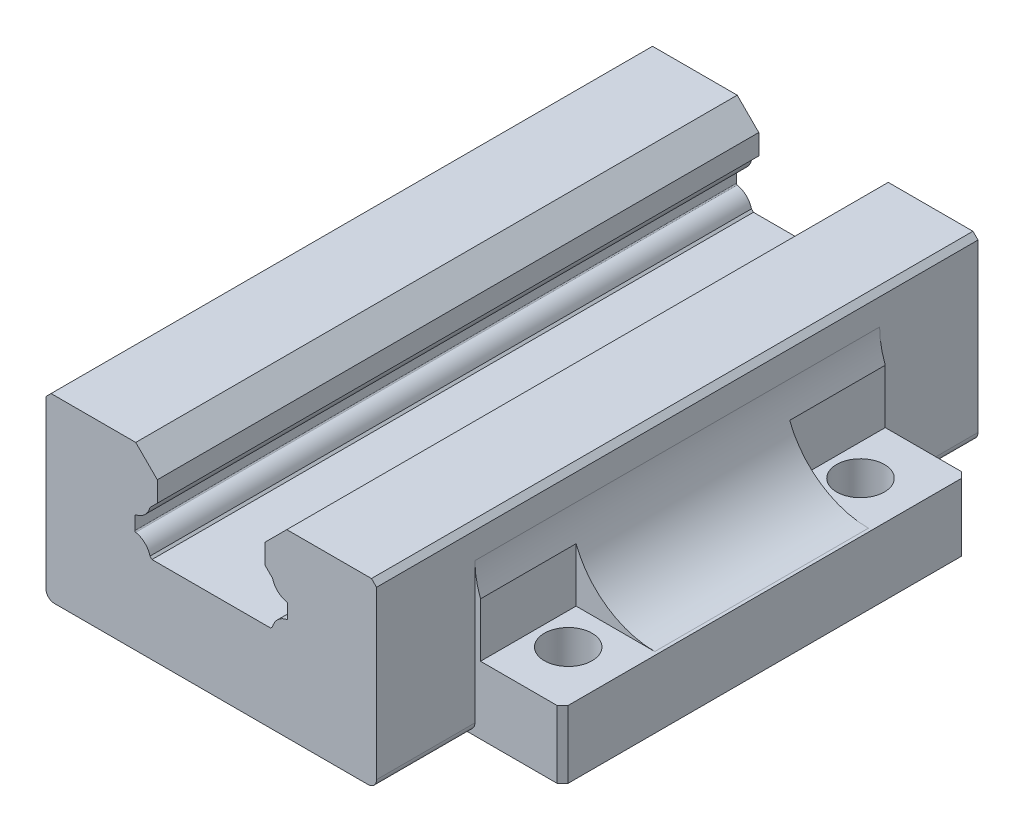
ISO-10303-21;
HEADER;
FILE_DESCRIPTION(('STEP AP214'),'2;1');
FILE_NAME('part.step','',(''),(''),'','','');
FILE_SCHEMA(('AUTOMOTIVE_DESIGN { 1 0 10303 214 1 1 1 1 }'));
ENDSEC;
DATA;
#1=APPLICATION_CONTEXT('core data for automotive mechanical design processes');
#2=APPLICATION_PROTOCOL_DEFINITION('international standard','automotive_design',2000,#1);
#3=PRODUCT_CONTEXT('',#1,'mechanical');
#4=PRODUCT('Part','Part','',(#3));
#5=PRODUCT_RELATED_PRODUCT_CATEGORY('part','',(#4));
#6=PRODUCT_DEFINITION_FORMATION('','',#4);
#7=PRODUCT_DEFINITION_CONTEXT('part definition',#1,'design');
#8=PRODUCT_DEFINITION('design','',#6,#7);
#9=PRODUCT_DEFINITION_SHAPE('','',#8);
#10=(LENGTH_UNIT() NAMED_UNIT(*) SI_UNIT(.MILLI.,.METRE.));
#11=(NAMED_UNIT(*) PLANE_ANGLE_UNIT() SI_UNIT($,.RADIAN.));
#12=(NAMED_UNIT(*) SI_UNIT($,.STERADIAN.) SOLID_ANGLE_UNIT());
#13=UNCERTAINTY_MEASURE_WITH_UNIT(LENGTH_MEASURE(1.E-05),#10,'distance_accuracy_value','');
#14=(GEOMETRIC_REPRESENTATION_CONTEXT(3) GLOBAL_UNCERTAINTY_ASSIGNED_CONTEXT((#13)) GLOBAL_UNIT_ASSIGNED_CONTEXT((#10,
#11,#12)) REPRESENTATION_CONTEXT('',''));
#15=CARTESIAN_POINT('',(0.,0.,0.));
#16=DIRECTION('',(0.,0.,1.));
#17=DIRECTION('',(1.,0.,0.));
#18=AXIS2_PLACEMENT_3D('',#15,#16,#17);
#19=CARTESIAN_POINT('',(-44.3999885,26.5,-57.2132034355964));
#20=DIRECTION('',(0.,0.,1.));
#21=DIRECTION('',(1.,0.,0.));
#22=AXIS2_PLACEMENT_3D('',#19,#20,#21);
#23=CYLINDRICAL_SURFACE('',#22,15.);
#24=DIRECTION('',(0.,0.,1.));
#25=VECTOR('',#24,1.);
#26=CARTESIAN_POINT('',(-44.3999885,11.5,-57.2132034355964));
#27=LINE('',#26,#25);
#28=CARTESIAN_POINT('',(-44.3999885,11.5,-19.));
#29=VERTEX_POINT('',#28);
#30=CARTESIAN_POINT('',(-44.3999885,11.5,19.));
#31=VERTEX_POINT('',#30);
#32=EDGE_CURVE('E587',#29,#31,#27,.T.);
#33=ORIENTED_EDGE('',*,*,#32,.T.);
#34=CARTESIAN_POINT('',(-44.3999885,26.5,19.));
#35=DIRECTION('',(0.,0.,1.));
#36=DIRECTION('',(1.,0.,0.));
#37=AXIS2_PLACEMENT_3D('',#34,#35,#36);
#38=CIRCLE('',#37,15.);
#39=CARTESIAN_POINT('',(-30.4,21.1148052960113,19.));
#40=VERTEX_POINT('',#39);
#41=EDGE_CURVE('E432',#31,#40,#38,.T.);
#42=ORIENTED_EDGE('',*,*,#41,.T.);
#43=DIRECTION('',(0.,0.,1.));
#44=VECTOR('',#43,1.);
#45=CARTESIAN_POINT('',(-30.4,21.1148052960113,-57.2132034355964));
#46=LINE('',#45,#44);
#47=CARTESIAN_POINT('',(-30.4,21.1148052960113,36.));
#48=VERTEX_POINT('',#47);
#49=EDGE_CURVE('E436',#40,#48,#46,.T.);
#50=ORIENTED_EDGE('',*,*,#49,.T.);
#51=CARTESIAN_POINT('',(-44.3999885,26.5,36.));
#52=DIRECTION('',(0.,0.,-1.));
#53=DIRECTION('',(-1.,0.,0.));
#54=AXIS2_PLACEMENT_3D('',#51,#52,#53);
#55=CIRCLE('',#54,15.);
#56=CARTESIAN_POINT('',(-29.3999999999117,26.4814258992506,36.));
#57=VERTEX_POINT('',#56);
#58=EDGE_CURVE('E581',#57,#48,#55,.T.);
#59=ORIENTED_EDGE('',*,*,#58,.F.);
#60=DIRECTION('',(0.,0.,1.));
#61=VECTOR('',#60,1.);
#62=CARTESIAN_POINT('',(-29.3999999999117,26.4814258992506,-57.2132034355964));
#63=LINE('',#62,#61);
#64=CARTESIAN_POINT('',(-29.3999999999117,26.4814258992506,-36.));
#65=VERTEX_POINT('',#64);
#66=EDGE_CURVE('E589',#57,#65,#63,.F.);
#67=ORIENTED_EDGE('',*,*,#66,.T.);
#68=CARTESIAN_POINT('',(-44.3999885,26.5,-36.));
#69=DIRECTION('',(0.,0.,-1.));
#70=DIRECTION('',(-1.,0.,0.));
#71=AXIS2_PLACEMENT_3D('',#68,#69,#70);
#72=CIRCLE('',#71,15.);
#73=CARTESIAN_POINT('',(-30.4,21.1148052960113,-36.));
#74=VERTEX_POINT('',#73);
#75=EDGE_CURVE('E584',#65,#74,#72,.T.);
#76=ORIENTED_EDGE('',*,*,#75,.T.);
#77=DIRECTION('',(0.,0.,1.));
#78=VECTOR('',#77,1.);
#79=CARTESIAN_POINT('',(-30.4,21.1148052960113,-57.2132034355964));
#80=LINE('',#79,#78);
#81=CARTESIAN_POINT('',(-30.4,21.1148052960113,-19.));
#82=VERTEX_POINT('',#81);
#83=EDGE_CURVE('E42',#82,#74,#80,.F.);
#84=ORIENTED_EDGE('',*,*,#83,.F.);
#85=CARTESIAN_POINT('',(-44.3999885,26.5,-19.));
#86=DIRECTION('',(0.,0.,-1.));
#87=DIRECTION('',(-1.,0.,0.));
#88=AXIS2_PLACEMENT_3D('',#85,#86,#87);
#89=CIRCLE('',#88,15.);
#90=EDGE_CURVE('E11',#82,#29,#89,.T.);
#91=ORIENTED_EDGE('',*,*,#90,.T.);
#92=EDGE_LOOP('',(#33,#42,#50,#59,#67,#76,#84,#91));
#93=FACE_BOUND('',#92,.T.);
#94=ADVANCED_FACE('F33',(#93),#23,.F.);
#95=CARTESIAN_POINT('',(-45.,11.5,36.));
#96=DIRECTION('',(0.,0.,1.));
#97=DIRECTION('',(1.,0.,0.));
#98=AXIS2_PLACEMENT_3D('',#95,#96,#97);
#99=PLANE('',#98);
#100=DIRECTION('',(0.,-1.,0.));
#101=VECTOR('',#100,1.);
#102=CARTESIAN_POINT('',(-30.4,26.4999999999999,36.));
#103=LINE('',#102,#101);
#104=CARTESIAN_POINT('',(-30.4,11.5,36.));
#105=VERTEX_POINT('',#104);
#106=EDGE_CURVE('E425',#48,#105,#103,.T.);
#107=ORIENTED_EDGE('',*,*,#106,.T.);
#108=DIRECTION('',(-1.,0.,0.));
#109=VECTOR('',#108,1.);
#110=CARTESIAN_POINT('',(-30.4,11.5,36.));
#111=LINE('',#110,#109);
#112=CARTESIAN_POINT('',(-44.,11.5,36.));
#113=VERTEX_POINT('',#112);
#114=EDGE_CURVE('E421',#105,#113,#111,.T.);
#115=ORIENTED_EDGE('',*,*,#114,.T.);
#116=DIRECTION('',(0.,-1.,0.));
#117=VECTOR('',#116,1.);
#118=CARTESIAN_POINT('',(-44.,11.5,36.));
#119=LINE('',#118,#117);
#120=CARTESIAN_POINT('',(-44.,-0.499999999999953,36.));
#121=VERTEX_POINT('',#120);
#122=EDGE_CURVE('E1234',#113,#121,#119,.T.);
#123=ORIENTED_EDGE('',*,*,#122,.T.);
#124=DIRECTION('',(-1.,0.,0.));
#125=VECTOR('',#124,1.);
#126=CARTESIAN_POINT('',(-25.,-0.499999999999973,36.));
#127=LINE('',#126,#125);
#128=CARTESIAN_POINT('',(-25.,-0.499999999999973,36.));
#129=VERTEX_POINT('',#128);
#130=EDGE_CURVE('E550',#129,#121,#127,.T.);
#131=ORIENTED_EDGE('',*,*,#130,.F.);
#132=DIRECTION('',(0.,1.,0.));
#133=VECTOR('',#132,1.);
#134=CARTESIAN_POINT('',(-25.,-0.499999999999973,36.));
#135=LINE('',#134,#133);
#136=CARTESIAN_POINT('',(-25.,-0.249999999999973,36.));
#137=VERTEX_POINT('',#136);
#138=EDGE_CURVE('E553',#129,#137,#135,.T.);
#139=ORIENTED_EDGE('',*,*,#138,.T.);
#140=DIRECTION('',(-1.,0.,0.));
#141=VECTOR('',#140,1.);
#142=CARTESIAN_POINT('',(-10.0000115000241,-0.249999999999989,36.));
#143=LINE('',#142,#141);
#144=CARTESIAN_POINT('',(-10.0000115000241,-0.249999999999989,36.));
#145=VERTEX_POINT('',#144);
#146=EDGE_CURVE('E512',#145,#137,#143,.T.);
#147=ORIENTED_EDGE('',*,*,#146,.F.);
#148=DIRECTION('',(0.,1.,0.));
#149=VECTOR('',#148,1.);
#150=CARTESIAN_POINT('',(-10.0000115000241,-0.499999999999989,36.));
#151=LINE('',#150,#149);
#152=CARTESIAN_POINT('',(-10.0000115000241,-0.499999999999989,36.));
#153=VERTEX_POINT('',#152);
#154=EDGE_CURVE('E530',#153,#145,#151,.T.);
#155=ORIENTED_EDGE('',*,*,#154,.F.);
#156=DIRECTION('',(-1.,0.,0.));
#157=VECTOR('',#156,1.);
#158=CARTESIAN_POINT('',(9.99998849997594,-0.500000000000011,36.));
#159=LINE('',#158,#157);
#160=CARTESIAN_POINT('',(9.99998849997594,-0.500000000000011,36.));
#161=VERTEX_POINT('',#160);
#162=EDGE_CURVE('E523',#161,#153,#159,.T.);
#163=ORIENTED_EDGE('',*,*,#162,.F.);
#164=DIRECTION('',(0.,1.,0.));
#165=VECTOR('',#164,1.);
#166=CARTESIAN_POINT('',(9.99998849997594,-0.500000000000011,36.));
#167=LINE('',#166,#165);
#168=CARTESIAN_POINT('',(9.99998849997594,-0.250000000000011,36.));
#169=VERTEX_POINT('',#168);
#170=EDGE_CURVE('E532',#161,#169,#167,.T.);
#171=ORIENTED_EDGE('',*,*,#170,.T.);
#172=DIRECTION('',(-1.,0.,0.));
#173=VECTOR('',#172,1.);
#174=CARTESIAN_POINT('',(25.,-0.250000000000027,36.));
#175=LINE('',#174,#173);
#176=CARTESIAN_POINT('',(25.,-0.250000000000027,36.));
#177=VERTEX_POINT('',#176);
#178=EDGE_CURVE('E500',#177,#169,#175,.T.);
#179=ORIENTED_EDGE('',*,*,#178,.F.);
#180=DIRECTION('',(0.,1.,0.));
#181=VECTOR('',#180,1.);
#182=CARTESIAN_POINT('',(25.,-0.500000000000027,36.));
#183=LINE('',#182,#181);
#184=CARTESIAN_POINT('',(25.,-0.500000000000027,36.));
#185=VERTEX_POINT('',#184);
#186=EDGE_CURVE('E579',#185,#177,#183,.T.);
#187=ORIENTED_EDGE('',*,*,#186,.F.);
#188=DIRECTION('',(-1.,0.,0.));
#189=VECTOR('',#188,1.);
#190=CARTESIAN_POINT('',(44.,-0.500000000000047,36.));
#191=LINE('',#190,#189);
#192=CARTESIAN_POINT('',(44.,-0.500000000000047,36.));
#193=VERTEX_POINT('',#192);
#194=EDGE_CURVE('E569',#193,#185,#191,.T.);
#195=ORIENTED_EDGE('',*,*,#194,.F.);
#196=DIRECTION('',(0.,1.,0.));
#197=VECTOR('',#196,1.);
#198=CARTESIAN_POINT('',(44.,11.5,36.));
#199=LINE('',#198,#197);
#200=CARTESIAN_POINT('',(44.,11.5,36.));
#201=VERTEX_POINT('',#200);
#202=EDGE_CURVE('E1127',#193,#201,#199,.T.);
#203=ORIENTED_EDGE('',*,*,#202,.T.);
#204=DIRECTION('',(1.,0.,0.));
#205=VECTOR('',#204,1.);
#206=CARTESIAN_POINT('',(30.4,11.5,36.));
#207=LINE('',#206,#205);
#208=CARTESIAN_POINT('',(30.4,11.5,36.));
#209=VERTEX_POINT('',#208);
#210=EDGE_CURVE('E463',#209,#201,#207,.T.);
#211=ORIENTED_EDGE('',*,*,#210,.F.);
#212=DIRECTION('',(0.,-1.,0.));
#213=VECTOR('',#212,1.);
#214=CARTESIAN_POINT('',(30.4,26.4999999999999,36.));
#215=LINE('',#214,#213);
#216=CARTESIAN_POINT('',(30.4,21.1148052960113,36.));
#217=VERTEX_POINT('',#216);
#218=EDGE_CURVE('E455',#217,#209,#215,.T.);
#219=ORIENTED_EDGE('',*,*,#218,.F.);
#220=CARTESIAN_POINT('',(44.3999885,26.5,36.));
#221=DIRECTION('',(0.,0.,-1.));
#222=DIRECTION('',(1.,0.,0.));
#223=AXIS2_PLACEMENT_3D('',#220,#221,#222);
#224=CIRCLE('',#223,15.);
#225=CARTESIAN_POINT('',(29.3999885,26.5,36.));
#226=VERTEX_POINT('',#225);
#227=EDGE_CURVE('E592',#217,#226,#224,.T.);
#228=ORIENTED_EDGE('',*,*,#227,.T.);
#229=DIRECTION('',(0.,-1.,0.));
#230=VECTOR('',#229,1.);
#231=CARTESIAN_POINT('',(29.3999885,31.149988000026,36.));
#232=LINE('',#231,#230);
#233=CARTESIAN_POINT('',(29.3999885,1.50000000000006,36.));
#234=VERTEX_POINT('',#233);
#235=EDGE_CURVE('E613',#226,#234,#232,.T.);
#236=ORIENTED_EDGE('',*,*,#235,.T.);
#237=CARTESIAN_POINT('',(27.8999885,1.50000000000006,36.));
#238=DIRECTION('',(0.,0.,1.));
#239=DIRECTION('',(1.,0.,0.));
#240=AXIS2_PLACEMENT_3D('',#237,#238,#239);
#241=CIRCLE('',#240,1.50000000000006);
#242=CARTESIAN_POINT('',(27.8999885,0.,36.));
#243=VERTEX_POINT('',#242);
#244=EDGE_CURVE('E608',#234,#243,#241,.F.);
#245=ORIENTED_EDGE('',*,*,#244,.T.);
#246=DIRECTION('',(-1.,0.,0.));
#247=VECTOR('',#246,1.);
#248=CARTESIAN_POINT('',(44.,0.,36.));
#249=LINE('',#248,#247);
#250=CARTESIAN_POINT('',(-27.89999425,0.,36.));
#251=VERTEX_POINT('',#250);
#252=EDGE_CURVE('E558',#243,#251,#249,.T.);
#253=ORIENTED_EDGE('',*,*,#252,.T.);
#254=CARTESIAN_POINT('',(-27.9,1.49999999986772,36.));
#255=DIRECTION('',(0.,0.,1.));
#256=DIRECTION('',(1.,0.,0.));
#257=AXIS2_PLACEMENT_3D('',#254,#255,#256);
#258=CIRCLE('',#257,1.49999999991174);
#259=CARTESIAN_POINT('',(-29.3999999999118,1.50000000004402,36.));
#260=VERTEX_POINT('',#259);
#261=EDGE_CURVE('E606',#251,#260,#258,.F.);
#262=ORIENTED_EDGE('',*,*,#261,.T.);
#263=DIRECTION('',(0.,1.,0.));
#264=VECTOR('',#263,1.);
#265=CARTESIAN_POINT('',(-29.3999999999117,31.1499995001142,36.));
#266=LINE('',#265,#264);
#267=EDGE_CURVE('E796',#260,#57,#266,.T.);
#268=ORIENTED_EDGE('',*,*,#267,.T.);
#269=ORIENTED_EDGE('',*,*,#58,.T.);
#270=EDGE_LOOP('',(#107,#115,#123,#131,#139,#147,#155,#163,#171,#179,#187,#195,#203,#211,#219,
#228,#236,#245,#253,#262,#268,#269));
#271=FACE_BOUND('',#270,.T.);
#272=ADVANCED_FACE('F1001',(#271),#99,.T.);
#273=CARTESIAN_POINT('',(-44.,11.5,36.));
#274=DIRECTION('',(0.707106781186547,0.,-0.707106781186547));
#275=DIRECTION('',(-0.707106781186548,0.,-0.707106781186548));
#276=AXIS2_PLACEMENT_3D('',#273,#274,#275);
#277=PLANE('',#276);
#278=ORIENTED_EDGE('',*,*,#122,.F.);
#279=DIRECTION('',(-0.707106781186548,0.,-0.707106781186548));
#280=VECTOR('',#279,1.);
#281=CARTESIAN_POINT('',(-44.,11.5,36.));
#282=LINE('',#281,#280);
#283=CARTESIAN_POINT('',(-45.,11.5,35.));
#284=VERTEX_POINT('',#283);
#285=EDGE_CURVE('E1239',#284,#113,#282,.F.);
#286=ORIENTED_EDGE('',*,*,#285,.F.);
#287=DIRECTION('',(0.,1.,0.));
#288=VECTOR('',#287,1.);
#289=CARTESIAN_POINT('',(-45.,11.5,35.));
#290=LINE('',#289,#288);
#291=CARTESIAN_POINT('',(-45.,-0.499999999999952,35.));
#292=VERTEX_POINT('',#291);
#293=EDGE_CURVE('E861',#292,#284,#290,.T.);
#294=ORIENTED_EDGE('',*,*,#293,.F.);
#295=DIRECTION('',(-0.707106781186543,0.,-0.707106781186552));
#296=VECTOR('',#295,1.);
#297=CARTESIAN_POINT('',(-44.,-0.499999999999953,36.));
#298=LINE('',#297,#296);
#299=EDGE_CURVE('E537',#121,#292,#298,.T.);
#300=ORIENTED_EDGE('',*,*,#299,.F.);
#301=EDGE_LOOP('',(#278,#286,#294,#300));
#302=FACE_BOUND('',#301,.T.);
#303=ADVANCED_FACE('F1007',(#302),#277,.F.);
#304=CARTESIAN_POINT('',(-36.,-0.499999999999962,26.));
#305=DIRECTION('',(0.,-1.,0.));
#306=DIRECTION('',(0.,0.,-1.));
#307=AXIS2_PLACEMENT_3D('',#304,#305,#306);
#308=CYLINDRICAL_SURFACE('',#307,4.24999999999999);
#309=CARTESIAN_POINT('',(-36.,-0.499999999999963,26.));
#310=DIRECTION('',(0.,-1.,0.));
#311=DIRECTION('',(0.,0.,-1.));
#312=AXIS2_PLACEMENT_3D('',#309,#310,#311);
#313=CIRCLE('',#312,4.24999999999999);
#314=CARTESIAN_POINT('',(-36.,-0.499999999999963,21.75));
#315=VERTEX_POINT('',#314);
#316=EDGE_CURVE('E482',#315,#315,#313,.T.);
#317=ORIENTED_EDGE('',*,*,#316,.T.);
#318=EDGE_LOOP('',(#317));
#319=FACE_BOUND('',#318,.T.);
#320=CARTESIAN_POINT('',(-36.,11.5,26.));
#321=DIRECTION('',(0.,1.,0.));
#322=DIRECTION('',(-1.,0.,0.));
#323=AXIS2_PLACEMENT_3D('',#320,#321,#322);
#324=CIRCLE('',#323,4.24999999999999);
#325=CARTESIAN_POINT('',(-40.25,11.5,26.));
#326=VERTEX_POINT('',#325);
#327=EDGE_CURVE('E37',#326,#326,#324,.F.);
#328=ORIENTED_EDGE('',*,*,#327,.F.);
#329=EDGE_LOOP('',(#328));
#330=FACE_BOUND('',#329,.T.);
#331=ADVANCED_FACE('F1028',(#319,#330),#308,.F.);
#332=CARTESIAN_POINT('',(-45.,11.5,-36.));
#333=DIRECTION('',(0.,0.,-1.));
#334=DIRECTION('',(-1.,0.,0.));
#335=AXIS2_PLACEMENT_3D('',#332,#333,#334);
#336=PLANE('',#335);
#337=DIRECTION('',(0.,1.,0.));
#338=VECTOR('',#337,1.);
#339=CARTESIAN_POINT('',(-44.,11.5,-36.));
#340=LINE('',#339,#338);
#341=CARTESIAN_POINT('',(-44.,-0.499999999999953,-36.));
#342=VERTEX_POINT('',#341);
#343=CARTESIAN_POINT('',(-44.,11.5,-36.));
#344=VERTEX_POINT('',#343);
#345=EDGE_CURVE('E1241',#342,#344,#340,.T.);
#346=ORIENTED_EDGE('',*,*,#345,.T.);
#347=DIRECTION('',(-1.,0.,0.));
#348=VECTOR('',#347,1.);
#349=CARTESIAN_POINT('',(-30.4,11.5,-36.));
#350=LINE('',#349,#348);
#351=CARTESIAN_POINT('',(-30.4,11.5,-36.));
#352=VERTEX_POINT('',#351);
#353=EDGE_CURVE('E450',#352,#344,#350,.T.);
#354=ORIENTED_EDGE('',*,*,#353,.F.);
#355=DIRECTION('',(0.,1.,0.));
#356=VECTOR('',#355,1.);
#357=CARTESIAN_POINT('',(-30.4,11.5,-36.));
#358=LINE('',#357,#356);
#359=EDGE_CURVE('E443',#352,#74,#358,.T.);
#360=ORIENTED_EDGE('',*,*,#359,.T.);
#361=ORIENTED_EDGE('',*,*,#75,.F.);
#362=DIRECTION('',(0.,-1.,0.));
#363=VECTOR('',#362,1.);
#364=CARTESIAN_POINT('',(-29.3999999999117,31.1499995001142,-36.));
#365=LINE('',#364,#363);
#366=CARTESIAN_POINT('',(-29.3999999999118,1.50000000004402,-36.));
#367=VERTEX_POINT('',#366);
#368=EDGE_CURVE('E859',#65,#367,#365,.T.);
#369=ORIENTED_EDGE('',*,*,#368,.T.);
#370=CARTESIAN_POINT('',(-27.9,1.49999999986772,-36.));
#371=DIRECTION('',(0.,0.,-1.));
#372=DIRECTION('',(-1.,0.,0.));
#373=AXIS2_PLACEMENT_3D('',#370,#371,#372);
#374=CIRCLE('',#373,1.49999999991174);
#375=CARTESIAN_POINT('',(-27.89999425,0.,-36.));
#376=VERTEX_POINT('',#375);
#377=EDGE_CURVE('E615',#367,#376,#374,.F.);
#378=ORIENTED_EDGE('',*,*,#377,.T.);
#379=DIRECTION('',(1.,0.,0.));
#380=VECTOR('',#379,1.);
#381=CARTESIAN_POINT('',(25.,0.,-36.));
#382=LINE('',#381,#380);
#383=CARTESIAN_POINT('',(27.8999885,0.,-36.));
#384=VERTEX_POINT('',#383);
#385=EDGE_CURVE('E563',#376,#384,#382,.T.);
#386=ORIENTED_EDGE('',*,*,#385,.T.);
#387=CARTESIAN_POINT('',(27.8999885,1.50000000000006,-36.));
#388=DIRECTION('',(0.,0.,-1.));
#389=DIRECTION('',(-1.,0.,0.));
#390=AXIS2_PLACEMENT_3D('',#387,#388,#389);
#391=CIRCLE('',#390,1.50000000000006);
#392=CARTESIAN_POINT('',(29.3999885,1.50000000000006,-36.));
#393=VERTEX_POINT('',#392);
#394=EDGE_CURVE('E618',#384,#393,#391,.F.);
#395=ORIENTED_EDGE('',*,*,#394,.T.);
#396=DIRECTION('',(0.,1.,0.));
#397=VECTOR('',#396,1.);
#398=CARTESIAN_POINT('',(29.3999885,31.149988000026,-36.));
#399=LINE('',#398,#397);
#400=CARTESIAN_POINT('',(29.3999885,26.5,-36.));
#401=VERTEX_POINT('',#400);
#402=EDGE_CURVE('E622',#393,#401,#399,.T.);
#403=ORIENTED_EDGE('',*,*,#402,.T.);
#404=CARTESIAN_POINT('',(44.3999885,26.5,-36.));
#405=DIRECTION('',(0.,0.,-1.));
#406=DIRECTION('',(-1.,0.,0.));
#407=AXIS2_PLACEMENT_3D('',#404,#405,#406);
#408=CIRCLE('',#407,15.);
#409=CARTESIAN_POINT('',(30.4,21.1148052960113,-36.));
#410=VERTEX_POINT('',#409);
#411=EDGE_CURVE('E594',#410,#401,#408,.T.);
#412=ORIENTED_EDGE('',*,*,#411,.F.);
#413=DIRECTION('',(0.,1.,0.));
#414=VECTOR('',#413,1.);
#415=CARTESIAN_POINT('',(30.4,11.5,-36.));
#416=LINE('',#415,#414);
#417=CARTESIAN_POINT('',(30.4,11.5,-36.));
#418=VERTEX_POINT('',#417);
#419=EDGE_CURVE('E473',#418,#410,#416,.T.);
#420=ORIENTED_EDGE('',*,*,#419,.F.);
#421=DIRECTION('',(1.,0.,0.));
#422=VECTOR('',#421,1.);
#423=CARTESIAN_POINT('',(30.4,11.5,-36.));
#424=LINE('',#423,#422);
#425=CARTESIAN_POINT('',(44.,11.5,-36.));
#426=VERTEX_POINT('',#425);
#427=EDGE_CURVE('E476',#418,#426,#424,.T.);
#428=ORIENTED_EDGE('',*,*,#427,.T.);
#429=DIRECTION('',(0.,-1.,0.));
#430=VECTOR('',#429,1.);
#431=CARTESIAN_POINT('',(44.,11.5,-36.));
#432=LINE('',#431,#430);
#433=CARTESIAN_POINT('',(44.,-0.500000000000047,-36.));
#434=VERTEX_POINT('',#433);
#435=EDGE_CURVE('E1231',#426,#434,#432,.T.);
#436=ORIENTED_EDGE('',*,*,#435,.T.);
#437=DIRECTION('',(1.,0.,0.));
#438=VECTOR('',#437,1.);
#439=CARTESIAN_POINT('',(25.,-0.500000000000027,-36.));
#440=LINE('',#439,#438);
#441=CARTESIAN_POINT('',(25.,-0.500000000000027,-36.));
#442=VERTEX_POINT('',#441);
#443=EDGE_CURVE('E573',#442,#434,#440,.T.);
#444=ORIENTED_EDGE('',*,*,#443,.F.);
#445=DIRECTION('',(0.,1.,0.));
#446=VECTOR('',#445,1.);
#447=CARTESIAN_POINT('',(25.,-0.500000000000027,-36.));
#448=LINE('',#447,#446);
#449=CARTESIAN_POINT('',(25.,-0.250000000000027,-36.));
#450=VERTEX_POINT('',#449);
#451=EDGE_CURVE('E576',#442,#450,#448,.T.);
#452=ORIENTED_EDGE('',*,*,#451,.T.);
#453=DIRECTION('',(1.,0.,0.));
#454=VECTOR('',#453,1.);
#455=CARTESIAN_POINT('',(9.99998849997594,-0.250000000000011,-36.));
#456=LINE('',#455,#454);
#457=CARTESIAN_POINT('',(9.99998849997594,-0.250000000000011,-36.));
#458=VERTEX_POINT('',#457);
#459=EDGE_CURVE('E494',#458,#450,#456,.T.);
#460=ORIENTED_EDGE('',*,*,#459,.F.);
#461=DIRECTION('',(0.,1.,0.));
#462=VECTOR('',#461,1.);
#463=CARTESIAN_POINT('',(9.99998849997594,-0.500000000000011,-36.));
#464=LINE('',#463,#462);
#465=CARTESIAN_POINT('',(9.99998849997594,-0.500000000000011,-36.));
#466=VERTEX_POINT('',#465);
#467=EDGE_CURVE('E535',#466,#458,#464,.T.);
#468=ORIENTED_EDGE('',*,*,#467,.F.);
#469=DIRECTION('',(1.,0.,0.));
#470=VECTOR('',#469,1.);
#471=CARTESIAN_POINT('',(-10.0000115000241,-0.499999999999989,-36.));
#472=LINE('',#471,#470);
#473=CARTESIAN_POINT('',(-10.0000115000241,-0.499999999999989,-36.));
#474=VERTEX_POINT('',#473);
#475=EDGE_CURVE('E518',#474,#466,#472,.T.);
#476=ORIENTED_EDGE('',*,*,#475,.F.);
#477=DIRECTION('',(0.,1.,0.));
#478=VECTOR('',#477,1.);
#479=CARTESIAN_POINT('',(-10.0000115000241,-0.499999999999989,-36.));
#480=LINE('',#479,#478);
#481=CARTESIAN_POINT('',(-10.0000115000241,-0.249999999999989,-36.));
#482=VERTEX_POINT('',#481);
#483=EDGE_CURVE('E527',#474,#482,#480,.T.);
#484=ORIENTED_EDGE('',*,*,#483,.T.);
#485=DIRECTION('',(1.,0.,0.));
#486=VECTOR('',#485,1.);
#487=CARTESIAN_POINT('',(-25.,-0.249999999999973,-36.));
#488=LINE('',#487,#486);
#489=CARTESIAN_POINT('',(-25.,-0.249999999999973,-36.));
#490=VERTEX_POINT('',#489);
#491=EDGE_CURVE('E506',#490,#482,#488,.T.);
#492=ORIENTED_EDGE('',*,*,#491,.F.);
#493=DIRECTION('',(0.,1.,0.));
#494=VECTOR('',#493,1.);
#495=CARTESIAN_POINT('',(-25.,-0.499999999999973,-36.));
#496=LINE('',#495,#494);
#497=CARTESIAN_POINT('',(-25.,-0.499999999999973,-36.));
#498=VERTEX_POINT('',#497);
#499=EDGE_CURVE('E556',#498,#490,#496,.T.);
#500=ORIENTED_EDGE('',*,*,#499,.F.);
#501=DIRECTION('',(1.,0.,0.));
#502=VECTOR('',#501,1.);
#503=CARTESIAN_POINT('',(-44.,-0.499999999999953,-36.));
#504=LINE('',#503,#502);
#505=EDGE_CURVE('E546',#342,#498,#504,.T.);
#506=ORIENTED_EDGE('',*,*,#505,.F.);
#507=EDGE_LOOP('',(#346,#354,#360,#361,#369,#378,#386,#395,#403,#412,#420,#428,#436,#444,#452,
#460,#468,#476,#484,#492,#500,#506));
#508=FACE_BOUND('',#507,.T.);
#509=ADVANCED_FACE('F1024',(#508),#336,.T.);
#510=CARTESIAN_POINT('',(-45.,11.5,-35.));
#511=DIRECTION('',(0.707106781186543,0.,0.707106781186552));
#512=DIRECTION('',(0.707106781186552,0.,-0.707106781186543));
#513=AXIS2_PLACEMENT_3D('',#510,#511,#512);
#514=PLANE('',#513);
#515=DIRECTION('',(0.707106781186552,0.,-0.707106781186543));
#516=VECTOR('',#515,1.);
#517=CARTESIAN_POINT('',(-45.,11.5,-35.));
#518=LINE('',#517,#516);
#519=CARTESIAN_POINT('',(-45.,11.5,-35.));
#520=VERTEX_POINT('',#519);
#521=EDGE_CURVE('E49',#344,#520,#518,.F.);
#522=ORIENTED_EDGE('',*,*,#521,.F.);
#523=ORIENTED_EDGE('',*,*,#345,.F.);
#524=DIRECTION('',(0.707106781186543,0.,-0.707106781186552));
#525=VECTOR('',#524,1.);
#526=CARTESIAN_POINT('',(-45.,-0.499999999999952,-35.));
#527=LINE('',#526,#525);
#528=CARTESIAN_POINT('',(-45.,-0.499999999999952,-35.));
#529=VERTEX_POINT('',#528);
#530=EDGE_CURVE('E543',#529,#342,#527,.T.);
#531=ORIENTED_EDGE('',*,*,#530,.F.);
#532=DIRECTION('',(0.,-1.,0.));
#533=VECTOR('',#532,1.);
#534=CARTESIAN_POINT('',(-45.,11.5,-35.));
#535=LINE('',#534,#533);
#536=EDGE_CURVE('E1243',#520,#529,#535,.T.);
#537=ORIENTED_EDGE('',*,*,#536,.F.);
#538=EDGE_LOOP('',(#522,#523,#531,#537));
#539=FACE_BOUND('',#538,.T.);
#540=ADVANCED_FACE('F1027',(#539),#514,.F.);
#541=CARTESIAN_POINT('',(-36.,-0.499999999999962,-26.));
#542=DIRECTION('',(0.,-1.,0.));
#543=DIRECTION('',(0.,0.,-1.));
#544=AXIS2_PLACEMENT_3D('',#541,#542,#543);
#545=CYLINDRICAL_SURFACE('',#544,4.24999999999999);
#546=CARTESIAN_POINT('',(-36.,-0.499999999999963,-26.));
#547=DIRECTION('',(0.,-1.,0.));
#548=DIRECTION('',(0.,0.,-1.));
#549=AXIS2_PLACEMENT_3D('',#546,#547,#548);
#550=CIRCLE('',#549,4.24999999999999);
#551=CARTESIAN_POINT('',(-36.,-0.499999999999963,-30.25));
#552=VERTEX_POINT('',#551);
#553=EDGE_CURVE('E491',#552,#552,#550,.T.);
#554=ORIENTED_EDGE('',*,*,#553,.T.);
#555=EDGE_LOOP('',(#554));
#556=FACE_BOUND('',#555,.T.);
#557=CARTESIAN_POINT('',(-36.,11.5,-26.));
#558=DIRECTION('',(0.,1.,0.));
#559=DIRECTION('',(-1.,0.,0.));
#560=AXIS2_PLACEMENT_3D('',#557,#558,#559);
#561=CIRCLE('',#560,4.24999999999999);
#562=CARTESIAN_POINT('',(-40.25,11.5,-26.));
#563=VERTEX_POINT('',#562);
#564=EDGE_CURVE('E453',#563,#563,#561,.F.);
#565=ORIENTED_EDGE('',*,*,#564,.F.);
#566=EDGE_LOOP('',(#565));
#567=FACE_BOUND('',#566,.T.);
#568=ADVANCED_FACE('F1089',(#556,#567),#545,.F.);
#569=CARTESIAN_POINT('',(-27.8999885,0.,-53.5));
#570=DIRECTION('',(0.,-1.,0.));
#571=DIRECTION('',(1.,0.,0.));
#572=AXIS2_PLACEMENT_3D('',#569,#570,#571);
#573=PLANE('',#572);
#574=ORIENTED_EDGE('',*,*,#385,.F.);
#575=DIRECTION('',(0.,0.,1.));
#576=VECTOR('',#575,1.);
#577=CARTESIAN_POINT('',(-27.8999885,0.,-53.5));
#578=LINE('',#577,#576);
#579=CARTESIAN_POINT('',(-27.8999885,0.,-53.5));
#580=VERTEX_POINT('',#579);
#581=EDGE_CURVE('E856',#580,#376,#578,.T.);
#582=ORIENTED_EDGE('',*,*,#581,.F.);
#583=DIRECTION('',(1.,0.,0.));
#584=VECTOR('',#583,1.);
#585=CARTESIAN_POINT('',(-27.8999885,0.,-53.5));
#586=LINE('',#585,#584);
#587=CARTESIAN_POINT('',(27.8999885,0.,-53.5));
#588=VERTEX_POINT('',#587);
#589=EDGE_CURVE('E721',#580,#588,#586,.T.);
#590=ORIENTED_EDGE('',*,*,#589,.T.);
#591=DIRECTION('',(0.,0.,1.));
#592=VECTOR('',#591,1.);
#593=CARTESIAN_POINT('',(27.8999885,0.,-53.5));
#594=LINE('',#593,#592);
#595=EDGE_CURVE('E843',#588,#384,#594,.T.);
#596=ORIENTED_EDGE('',*,*,#595,.T.);
#597=EDGE_LOOP('',(#574,#582,#590,#596));
#598=FACE_BOUND('',#597,.T.);
#599=ADVANCED_FACE('F1087',(#598),#573,.T.);
#600=CARTESIAN_POINT('',(-27.8999885,0.,53.5));
#601=VERTEX_POINT('',#600);
#602=EDGE_CURVE('E853',#251,#601,#578,.T.);
#603=ORIENTED_EDGE('',*,*,#602,.F.);
#604=ORIENTED_EDGE('',*,*,#252,.F.);
#605=CARTESIAN_POINT('',(27.8999885,0.,53.5));
#606=VERTEX_POINT('',#605);
#607=EDGE_CURVE('E846',#243,#606,#594,.T.);
#608=ORIENTED_EDGE('',*,*,#607,.T.);
#609=DIRECTION('',(1.,0.,0.));
#610=VECTOR('',#609,1.);
#611=CARTESIAN_POINT('',(-27.8999885,0.,53.5));
#612=LINE('',#611,#610);
#613=EDGE_CURVE('E637',#601,#606,#612,.T.);
#614=ORIENTED_EDGE('',*,*,#613,.F.);
#615=EDGE_LOOP('',(#603,#604,#608,#614));
#616=FACE_BOUND('',#615,.T.);
#617=ADVANCED_FACE('F882',(#616),#573,.T.);
#618=CARTESIAN_POINT('',(25.,-0.500000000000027,-36.));
#619=DIRECTION('',(1.,0.,0.));
#620=DIRECTION('',(0.,1.,0.));
#621=AXIS2_PLACEMENT_3D('',#618,#619,#620);
#622=PLANE('',#621);
#623=DIRECTION('',(0.,0.,1.));
#624=VECTOR('',#623,1.);
#625=CARTESIAN_POINT('',(25.,-0.250000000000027,36.));
#626=LINE('',#625,#624);
#627=EDGE_CURVE('E497',#450,#177,#626,.T.);
#628=ORIENTED_EDGE('',*,*,#627,.F.);
#629=ORIENTED_EDGE('',*,*,#451,.F.);
#630=DIRECTION('',(0.,0.,-1.));
#631=VECTOR('',#630,1.);
#632=CARTESIAN_POINT('',(25.,-0.500000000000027,-36.));
#633=LINE('',#632,#631);
#634=EDGE_CURVE('E571',#185,#442,#633,.T.);
#635=ORIENTED_EDGE('',*,*,#634,.F.);
#636=ORIENTED_EDGE('',*,*,#186,.T.);
#637=EDGE_LOOP('',(#628,#629,#635,#636));
#638=FACE_BOUND('',#637,.T.);
#639=ADVANCED_FACE('F1012',(#638),#622,.F.);
#640=CARTESIAN_POINT('',(9.99998849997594,-0.500000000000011,-36.));
#641=DIRECTION('',(-1.,0.,0.));
#642=DIRECTION('',(0.,-1.,0.));
#643=AXIS2_PLACEMENT_3D('',#640,#641,#642);
#644=PLANE('',#643);
#645=DIRECTION('',(0.,0.,-1.));
#646=VECTOR('',#645,1.);
#647=CARTESIAN_POINT('',(9.99998849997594,-0.250000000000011,-36.));
#648=LINE('',#647,#646);
#649=EDGE_CURVE('E503',#169,#458,#648,.T.);
#650=ORIENTED_EDGE('',*,*,#649,.F.);
#651=ORIENTED_EDGE('',*,*,#170,.F.);
#652=DIRECTION('',(0.,0.,1.));
#653=VECTOR('',#652,1.);
#654=CARTESIAN_POINT('',(9.99998849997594,-0.500000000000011,-36.));
#655=LINE('',#654,#653);
#656=EDGE_CURVE('E521',#466,#161,#655,.T.);
#657=ORIENTED_EDGE('',*,*,#656,.F.);
#658=ORIENTED_EDGE('',*,*,#467,.T.);
#659=EDGE_LOOP('',(#650,#651,#657,#658));
#660=FACE_BOUND('',#659,.T.);
#661=ADVANCED_FACE('F1208',(#660),#644,.F.);
#662=CARTESIAN_POINT('',(-25.,-0.499999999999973,36.));
#663=DIRECTION('',(-1.,0.,0.));
#664=DIRECTION('',(0.,-1.,0.));
#665=AXIS2_PLACEMENT_3D('',#662,#663,#664);
#666=PLANE('',#665);
#667=DIRECTION('',(0.,0.,-1.));
#668=VECTOR('',#667,1.);
#669=CARTESIAN_POINT('',(-25.,-0.249999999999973,-36.));
#670=LINE('',#669,#668);
#671=EDGE_CURVE('E515',#137,#490,#670,.T.);
#672=ORIENTED_EDGE('',*,*,#671,.F.);
#673=ORIENTED_EDGE('',*,*,#138,.F.);
#674=DIRECTION('',(0.,0.,1.));
#675=VECTOR('',#674,1.);
#676=CARTESIAN_POINT('',(-25.,-0.499999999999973,36.));
#677=LINE('',#676,#675);
#678=EDGE_CURVE('E548',#498,#129,#677,.T.);
#679=ORIENTED_EDGE('',*,*,#678,.F.);
#680=ORIENTED_EDGE('',*,*,#499,.T.);
#681=EDGE_LOOP('',(#672,#673,#679,#680));
#682=FACE_BOUND('',#681,.T.);
#683=ADVANCED_FACE('F1206',(#682),#666,.F.);
#684=CARTESIAN_POINT('',(-10.0000115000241,-0.499999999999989,-36.));
#685=DIRECTION('',(1.,0.,0.));
#686=DIRECTION('',(0.,1.,0.));
#687=AXIS2_PLACEMENT_3D('',#684,#685,#686);
#688=PLANE('',#687);
#689=DIRECTION('',(0.,0.,1.));
#690=VECTOR('',#689,1.);
#691=CARTESIAN_POINT('',(-10.0000115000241,-0.249999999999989,36.));
#692=LINE('',#691,#690);
#693=EDGE_CURVE('E509',#482,#145,#692,.T.);
#694=ORIENTED_EDGE('',*,*,#693,.F.);
#695=ORIENTED_EDGE('',*,*,#483,.F.);
#696=DIRECTION('',(0.,0.,-1.));
#697=VECTOR('',#696,1.);
#698=CARTESIAN_POINT('',(-10.0000115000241,-0.499999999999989,-36.));
#699=LINE('',#698,#697);
#700=EDGE_CURVE('E525',#153,#474,#699,.T.);
#701=ORIENTED_EDGE('',*,*,#700,.F.);
#702=ORIENTED_EDGE('',*,*,#154,.T.);
#703=EDGE_LOOP('',(#694,#695,#701,#702));
#704=FACE_BOUND('',#703,.T.);
#705=ADVANCED_FACE('F1203',(#704),#688,.F.);
#706=CARTESIAN_POINT('',(45.,11.5,-36.));
#707=DIRECTION('',(0.,-1.,0.));
#708=DIRECTION('',(1.,0.,0.));
#709=AXIS2_PLACEMENT_3D('',#706,#707,#708);
#710=PLANE('',#709);
#711=DIRECTION('',(0.,0.,1.));
#712=VECTOR('',#711,1.);
#713=CARTESIAN_POINT('',(44.3999885,11.5,-57.2132034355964));
#714=LINE('',#713,#712);
#715=CARTESIAN_POINT('',(44.3999885,11.5,-19.));
#716=VERTEX_POINT('',#715);
#717=CARTESIAN_POINT('',(44.3999885,11.5,19.));
#718=VERTEX_POINT('',#717);
#719=EDGE_CURVE('E599',#716,#718,#714,.T.);
#720=ORIENTED_EDGE('',*,*,#719,.T.);
#721=DIRECTION('',(1.,0.,0.));
#722=VECTOR('',#721,1.);
#723=CARTESIAN_POINT('',(30.4,11.5,19.));
#724=LINE('',#723,#722);
#725=CARTESIAN_POINT('',(30.4,11.5,19.));
#726=VERTEX_POINT('',#725);
#727=EDGE_CURVE('E464',#726,#718,#724,.T.);
#728=ORIENTED_EDGE('',*,*,#727,.F.);
#729=DIRECTION('',(0.,0.,-1.));
#730=VECTOR('',#729,1.);
#731=CARTESIAN_POINT('',(30.4,11.5,19.));
#732=LINE('',#731,#730);
#733=EDGE_CURVE('E457',#209,#726,#732,.T.);
#734=ORIENTED_EDGE('',*,*,#733,.F.);
#735=ORIENTED_EDGE('',*,*,#210,.T.);
#736=DIRECTION('',(-0.707106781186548,0.,0.707106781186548));
#737=VECTOR('',#736,1.);
#738=CARTESIAN_POINT('',(45.,11.5,35.));
#739=LINE('',#738,#737);
#740=CARTESIAN_POINT('',(45.,11.5,35.));
#741=VERTEX_POINT('',#740);
#742=EDGE_CURVE('E57',#201,#741,#739,.F.);
#743=ORIENTED_EDGE('',*,*,#742,.T.);
#744=DIRECTION('',(0.,0.,1.));
#745=VECTOR('',#744,1.);
#746=CARTESIAN_POINT('',(45.,11.5,36.));
#747=LINE('',#746,#745);
#748=CARTESIAN_POINT('',(45.,11.5,-35.));
#749=VERTEX_POINT('',#748);
#750=EDGE_CURVE('E602',#749,#741,#747,.T.);
#751=ORIENTED_EDGE('',*,*,#750,.F.);
#752=DIRECTION('',(0.707106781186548,0.,0.707106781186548));
#753=VECTOR('',#752,1.);
#754=CARTESIAN_POINT('',(44.,11.5,-36.));
#755=LINE('',#754,#753);
#756=EDGE_CURVE('E1125',#749,#426,#755,.F.);
#757=ORIENTED_EDGE('',*,*,#756,.T.);
#758=ORIENTED_EDGE('',*,*,#427,.F.);
#759=DIRECTION('',(0.,0.,-1.));
#760=VECTOR('',#759,1.);
#761=CARTESIAN_POINT('',(30.4,11.5,-36.));
#762=LINE('',#761,#760);
#763=CARTESIAN_POINT('',(30.4,11.5,-19.));
#764=VERTEX_POINT('',#763);
#765=EDGE_CURVE('E470',#764,#418,#762,.T.);
#766=ORIENTED_EDGE('',*,*,#765,.F.);
#767=DIRECTION('',(1.,0.,0.));
#768=VECTOR('',#767,1.);
#769=CARTESIAN_POINT('',(30.4,11.5,-19.));
#770=LINE('',#769,#768);
#771=EDGE_CURVE('E475',#764,#716,#770,.T.);
#772=ORIENTED_EDGE('',*,*,#771,.T.);
#773=EDGE_LOOP('',(#720,#728,#734,#735,#743,#751,#757,#758,#766,#772));
#774=FACE_BOUND('',#773,.T.);
#775=CARTESIAN_POINT('',(36.,11.5,-26.));
#776=DIRECTION('',(0.,-1.,0.));
#777=DIRECTION('',(1.,0.,0.));
#778=AXIS2_PLACEMENT_3D('',#775,#776,#777);
#779=CIRCLE('',#778,4.24999999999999);
#780=CARTESIAN_POINT('',(40.25,11.5,-26.));
#781=VERTEX_POINT('',#780);
#782=EDGE_CURVE('E479',#781,#781,#779,.F.);
#783=ORIENTED_EDGE('',*,*,#782,.F.);
#784=EDGE_LOOP('',(#783));
#785=FACE_BOUND('',#784,.T.);
#786=CARTESIAN_POINT('',(36.,11.5,26.));
#787=DIRECTION('',(0.,-1.,0.));
#788=DIRECTION('',(1.,0.,0.));
#789=AXIS2_PLACEMENT_3D('',#786,#787,#788);
#790=CIRCLE('',#789,4.24999999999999);
#791=CARTESIAN_POINT('',(40.25,11.5,26.));
#792=VERTEX_POINT('',#791);
#793=EDGE_CURVE('E466',#792,#792,#790,.F.);
#794=ORIENTED_EDGE('',*,*,#793,.F.);
#795=EDGE_LOOP('',(#794));
#796=FACE_BOUND('',#795,.T.);
#797=ADVANCED_FACE('F1023',(#774,#785,#796),#710,.F.);
#798=CARTESIAN_POINT('',(27.8999885,1.50000000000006,-53.5));
#799=DIRECTION('',(0.,0.,1.));
#800=DIRECTION('',(1.,0.,0.));
#801=AXIS2_PLACEMENT_3D('',#798,#799,#800);
#802=CYLINDRICAL_SURFACE('',#801,1.50000000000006);
#803=ORIENTED_EDGE('',*,*,#394,.F.);
#804=ORIENTED_EDGE('',*,*,#595,.F.);
#805=CARTESIAN_POINT('',(27.8999885,1.50000000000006,-53.5));
#806=DIRECTION('',(0.,0.,1.));
#807=DIRECTION('',(1.,0.,0.));
#808=AXIS2_PLACEMENT_3D('',#805,#806,#807);
#809=CIRCLE('',#808,1.50000000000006);
#810=CARTESIAN_POINT('',(29.3999885,1.50000000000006,-53.5));
#811=VERTEX_POINT('',#810);
#812=EDGE_CURVE('E724',#588,#811,#809,.T.);
#813=ORIENTED_EDGE('',*,*,#812,.T.);
#814=DIRECTION('',(0.,0.,1.));
#815=VECTOR('',#814,1.);
#816=CARTESIAN_POINT('',(29.3999885,1.50000000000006,-53.5));
#817=LINE('',#816,#815);
#818=EDGE_CURVE('E839',#811,#393,#817,.T.);
#819=ORIENTED_EDGE('',*,*,#818,.T.);
#820=EDGE_LOOP('',(#803,#804,#813,#819));
#821=FACE_BOUND('',#820,.T.);
#822=ADVANCED_FACE('F1086',(#821),#802,.T.);
#823=CARTESIAN_POINT('',(-27.9,1.49999999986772,-53.5));
#824=DIRECTION('',(0.,0.,1.));
#825=DIRECTION('',(1.,0.,0.));
#826=AXIS2_PLACEMENT_3D('',#823,#824,#825);
#827=CYLINDRICAL_SURFACE('',#826,1.49999999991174);
#828=ORIENTED_EDGE('',*,*,#377,.F.);
#829=DIRECTION('',(0.,0.,1.));
#830=VECTOR('',#829,1.);
#831=CARTESIAN_POINT('',(-29.3999999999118,1.50000000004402,-53.5));
#832=LINE('',#831,#830);
#833=CARTESIAN_POINT('',(-29.3999999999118,1.50000000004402,-53.5));
#834=VERTEX_POINT('',#833);
#835=EDGE_CURVE('E849',#834,#367,#832,.T.);
#836=ORIENTED_EDGE('',*,*,#835,.F.);
#837=CARTESIAN_POINT('',(-27.9,1.49999999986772,-53.5));
#838=DIRECTION('',(0.,0.,1.));
#839=DIRECTION('',(1.,0.,0.));
#840=AXIS2_PLACEMENT_3D('',#837,#838,#839);
#841=CIRCLE('',#840,1.49999999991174);
#842=EDGE_CURVE('E718',#834,#580,#841,.T.);
#843=ORIENTED_EDGE('',*,*,#842,.T.);
#844=ORIENTED_EDGE('',*,*,#581,.T.);
#845=EDGE_LOOP('',(#828,#836,#843,#844));
#846=FACE_BOUND('',#845,.T.);
#847=ADVANCED_FACE('F999',(#846),#827,.T.);
#848=CARTESIAN_POINT('',(-13.4343140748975,32.0499880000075,-53.5));
#849=DIRECTION('',(0.,1.,0.));
#850=DIRECTION('',(0.,0.,1.));
#851=AXIS2_PLACEMENT_3D('',#848,#849,#850);
#852=PLANE('',#851);
#853=DIRECTION('',(0.,0.,1.));
#854=VECTOR('',#853,1.);
#855=CARTESIAN_POINT('',(-28.5000115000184,32.0499880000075,-53.5));
#856=LINE('',#855,#854);
#857=CARTESIAN_POINT('',(-28.5000115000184,32.0499880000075,-53.5));
#858=VERTEX_POINT('',#857);
#859=CARTESIAN_POINT('',(-28.5000115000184,32.0499880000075,53.5));
#860=VERTEX_POINT('',#859);
#861=EDGE_CURVE('E793',#858,#860,#856,.T.);
#862=ORIENTED_EDGE('',*,*,#861,.T.);
#863=DIRECTION('',(-1.,0.,0.));
#864=VECTOR('',#863,1.);
#865=CARTESIAN_POINT('',(-13.4343140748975,32.0499880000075,53.5));
#866=LINE('',#865,#864);
#867=CARTESIAN_POINT('',(-13.4343140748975,32.0499880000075,53.5));
#868=VERTEX_POINT('',#867);
#869=EDGE_CURVE('E625',#868,#860,#866,.T.);
#870=ORIENTED_EDGE('',*,*,#869,.F.);
#871=DIRECTION('',(0.,0.,1.));
#872=VECTOR('',#871,1.);
#873=CARTESIAN_POINT('',(-13.4343140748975,32.0499880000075,-53.5));
#874=LINE('',#873,#872);
#875=CARTESIAN_POINT('',(-13.4343140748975,32.0499880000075,-53.5));
#876=VERTEX_POINT('',#875);
#877=EDGE_CURVE('E794',#876,#868,#874,.T.);
#878=ORIENTED_EDGE('',*,*,#877,.F.);
#879=DIRECTION('',(-1.,0.,0.));
#880=VECTOR('',#879,1.);
#881=CARTESIAN_POINT('',(-13.4343140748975,32.0499880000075,-53.5));
#882=LINE('',#881,#880);
#883=EDGE_CURVE('E709',#876,#858,#882,.T.);
#884=ORIENTED_EDGE('',*,*,#883,.T.);
#885=EDGE_LOOP('',(#862,#870,#878,#884));
#886=FACE_BOUND('',#885,.T.);
#887=ADVANCED_FACE('F984',(#886),#852,.T.);
#888=CARTESIAN_POINT('',(-13.4343140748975,32.0499880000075,-53.5));
#889=DIRECTION('',(0.707106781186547,0.707106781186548,0.));
#890=DIRECTION('',(-0.707106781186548,0.707106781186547,0.));
#891=AXIS2_PLACEMENT_3D('',#888,#889,#890);
#892=PLANE('',#891);
#893=ORIENTED_EDGE('',*,*,#877,.T.);
#894=DIRECTION('',(-0.707106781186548,0.707106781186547,0.));
#895=VECTOR('',#894,1.);
#896=CARTESIAN_POINT('',(-13.4343140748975,32.0499880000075,53.5));
#897=LINE('',#896,#895);
#898=CARTESIAN_POINT('',(-9.60001150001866,28.2156854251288,53.5));
#899=VERTEX_POINT('',#898);
#900=EDGE_CURVE('E706',#899,#868,#897,.T.);
#901=ORIENTED_EDGE('',*,*,#900,.F.);
#902=DIRECTION('',(0.,0.,1.));
#903=VECTOR('',#902,1.);
#904=CARTESIAN_POINT('',(-9.60001150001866,28.2156854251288,-53.5));
#905=LINE('',#904,#903);
#906=CARTESIAN_POINT('',(-9.60001150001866,28.2156854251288,-53.5));
#907=VERTEX_POINT('',#906);
#908=EDGE_CURVE('E797',#907,#899,#905,.T.);
#909=ORIENTED_EDGE('',*,*,#908,.F.);
#910=DIRECTION('',(-0.707106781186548,0.707106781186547,0.));
#911=VECTOR('',#910,1.);
#912=CARTESIAN_POINT('',(-13.4343140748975,32.0499880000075,-53.5));
#913=LINE('',#912,#911);
#914=EDGE_CURVE('E790',#907,#876,#913,.T.);
#915=ORIENTED_EDGE('',*,*,#914,.T.);
#916=EDGE_LOOP('',(#893,#901,#909,#915));
#917=FACE_BOUND('',#916,.T.);
#918=ADVANCED_FACE('F982',(#917),#892,.T.);
#919=CARTESIAN_POINT('',(-9.60001150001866,28.2156854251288,-53.5));
#920=DIRECTION('',(1.,0.,0.));
#921=DIRECTION('',(0.,0.,-1.));
#922=AXIS2_PLACEMENT_3D('',#919,#920,#921);
#923=PLANE('',#922);
#924=ORIENTED_EDGE('',*,*,#908,.T.);
#925=DIRECTION('',(0.,1.,0.));
#926=VECTOR('',#925,1.);
#927=CARTESIAN_POINT('',(-9.60001150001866,28.2156854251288,53.5));
#928=LINE('',#927,#926);
#929=CARTESIAN_POINT('',(-9.60001150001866,24.5957530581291,53.5));
#930=VERTEX_POINT('',#929);
#931=EDGE_CURVE('E703',#930,#899,#928,.T.);
#932=ORIENTED_EDGE('',*,*,#931,.F.);
#933=DIRECTION('',(0.,0.,1.));
#934=VECTOR('',#933,1.);
#935=CARTESIAN_POINT('',(-9.60001150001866,24.5957530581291,-53.5));
#936=LINE('',#935,#934);
#937=CARTESIAN_POINT('',(-9.60001150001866,24.5957530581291,-53.5));
#938=VERTEX_POINT('',#937);
#939=EDGE_CURVE('E799',#938,#930,#936,.T.);
#940=ORIENTED_EDGE('',*,*,#939,.F.);
#941=DIRECTION('',(0.,1.,0.));
#942=VECTOR('',#941,1.);
#943=CARTESIAN_POINT('',(-9.60001150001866,28.2156854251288,-53.5));
#944=LINE('',#943,#942);
#945=EDGE_CURVE('E787',#938,#907,#944,.T.);
#946=ORIENTED_EDGE('',*,*,#945,.T.);
#947=EDGE_LOOP('',(#924,#932,#940,#946));
#948=FACE_BOUND('',#947,.T.);
#949=ADVANCED_FACE('F977',(#948),#923,.T.);
#950=CARTESIAN_POINT('',(-9.60001150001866,24.5957530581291,-53.5));
#951=DIRECTION('',(0.707106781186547,-0.707106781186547,0.));
#952=DIRECTION('',(0.707106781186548,0.707106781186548,0.));
#953=AXIS2_PLACEMENT_3D('',#950,#951,#952);
#954=PLANE('',#953);
#955=ORIENTED_EDGE('',*,*,#939,.T.);
#956=DIRECTION('',(0.707106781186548,0.707106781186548,0.));
#957=VECTOR('',#956,1.);
#958=CARTESIAN_POINT('',(-9.60001150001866,24.5957530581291,53.5));
#959=LINE('',#958,#957);
#960=CARTESIAN_POINT('',(-10.8987935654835,23.2969709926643,53.5));
#961=VERTEX_POINT('',#960);
#962=EDGE_CURVE('E700',#961,#930,#959,.T.);
#963=ORIENTED_EDGE('',*,*,#962,.F.);
#964=DIRECTION('',(0.,0.,1.));
#965=VECTOR('',#964,1.);
#966=CARTESIAN_POINT('',(-10.8987935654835,23.2969709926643,-53.5));
#967=LINE('',#966,#965);
#968=CARTESIAN_POINT('',(-10.8987935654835,23.2969709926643,-53.5));
#969=VERTEX_POINT('',#968);
#970=EDGE_CURVE('E801',#969,#961,#967,.T.);
#971=ORIENTED_EDGE('',*,*,#970,.F.);
#972=DIRECTION('',(0.707106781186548,0.707106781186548,0.));
#973=VECTOR('',#972,1.);
#974=CARTESIAN_POINT('',(-9.60001150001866,24.5957530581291,-53.5));
#975=LINE('',#974,#973);
#976=EDGE_CURVE('E784',#969,#938,#975,.T.);
#977=ORIENTED_EDGE('',*,*,#976,.T.);
#978=EDGE_LOOP('',(#955,#963,#971,#977));
#979=FACE_BOUND('',#978,.T.);
#980=ADVANCED_FACE('F973',(#979),#954,.T.);
#981=CARTESIAN_POINT('',(-14.0818595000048,24.1249960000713,-53.5));
#982=DIRECTION('',(0.,0.,1.));
#983=DIRECTION('',(1.,0.,0.));
#984=AXIS2_PLACEMENT_3D('',#981,#982,#983);
#985=CYLINDRICAL_SURFACE('',#984,3.28900200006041);
#986=ORIENTED_EDGE('',*,*,#970,.T.);
#987=CARTESIAN_POINT('',(-14.0818595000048,24.1249960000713,53.5));
#988=DIRECTION('',(0.,0.,1.));
#989=DIRECTION('',(1.,0.,0.));
#990=AXIS2_PLACEMENT_3D('',#987,#988,#989);
#991=CIRCLE('',#990,3.28900200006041);
#992=CARTESIAN_POINT('',(-13.4390970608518,20.8994122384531,53.5));
#993=VERTEX_POINT('',#992);
#994=EDGE_CURVE('E697',#993,#961,#991,.T.);
#995=ORIENTED_EDGE('',*,*,#994,.F.);
#996=DIRECTION('',(0.,0.,1.));
#997=VECTOR('',#996,1.);
#998=CARTESIAN_POINT('',(-13.4390970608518,20.8994122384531,-53.5));
#999=LINE('',#998,#997);
#1000=CARTESIAN_POINT('',(-13.4390970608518,20.8994122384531,-53.5));
#1001=VERTEX_POINT('',#1000);
#1002=EDGE_CURVE('E803',#1001,#993,#999,.T.);
#1003=ORIENTED_EDGE('',*,*,#1002,.F.);
#1004=CARTESIAN_POINT('',(-14.0818595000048,24.1249960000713,-53.5));
#1005=DIRECTION('',(0.,0.,1.));
#1006=DIRECTION('',(1.,0.,0.));
#1007=AXIS2_PLACEMENT_3D('',#1004,#1005,#1006);
#1008=CIRCLE('',#1007,3.28900200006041);
#1009=EDGE_CURVE('E781',#1001,#969,#1008,.T.);
#1010=ORIENTED_EDGE('',*,*,#1009,.T.);
#1011=EDGE_LOOP('',(#986,#995,#1003,#1010));
#1012=FACE_BOUND('',#1011,.T.);
#1013=ADVANCED_FACE('F971',(#1012),#985,.T.);
#1014=CARTESIAN_POINT('',(-13.4000114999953,20.7032686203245,-53.5));
#1015=DIRECTION('',(0.,0.,1.));
#1016=DIRECTION('',(1.,0.,0.));
#1017=AXIS2_PLACEMENT_3D('',#1014,#1015,#1016);
#1018=CYLINDRICAL_SURFACE('',#1017,0.200000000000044);
#1019=ORIENTED_EDGE('',*,*,#1002,.T.);
#1020=CARTESIAN_POINT('',(-13.4000114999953,20.7032686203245,53.5));
#1021=DIRECTION('',(0.,0.,-1.));
#1022=DIRECTION('',(1.,0.,0.));
#1023=AXIS2_PLACEMENT_3D('',#1020,#1021,#1022);
#1024=CIRCLE('',#1023,0.200000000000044);
#1025=CARTESIAN_POINT('',(-13.6000114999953,20.7032686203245,53.5));
#1026=VERTEX_POINT('',#1025);
#1027=EDGE_CURVE('E694',#1026,#993,#1024,.T.);
#1028=ORIENTED_EDGE('',*,*,#1027,.F.);
#1029=DIRECTION('',(0.,0.,1.));
#1030=VECTOR('',#1029,1.);
#1031=CARTESIAN_POINT('',(-13.6000114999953,20.7032686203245,-53.5));
#1032=LINE('',#1031,#1030);
#1033=CARTESIAN_POINT('',(-13.6000114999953,20.7032686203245,-53.5));
#1034=VERTEX_POINT('',#1033);
#1035=EDGE_CURVE('E805',#1034,#1026,#1032,.T.);
#1036=ORIENTED_EDGE('',*,*,#1035,.F.);
#1037=CARTESIAN_POINT('',(-13.4000114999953,20.7032686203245,-53.5));
#1038=DIRECTION('',(0.,0.,-1.));
#1039=DIRECTION('',(1.,0.,0.));
#1040=AXIS2_PLACEMENT_3D('',#1037,#1038,#1039);
#1041=CIRCLE('',#1040,0.200000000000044);
#1042=EDGE_CURVE('E778',#1034,#1001,#1041,.T.);
#1043=ORIENTED_EDGE('',*,*,#1042,.T.);
#1044=EDGE_LOOP('',(#1019,#1028,#1036,#1043));
#1045=FACE_BOUND('',#1044,.T.);
#1046=ADVANCED_FACE('F966',(#1045),#1018,.F.);
#1047=CARTESIAN_POINT('',(-13.6000114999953,20.7032686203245,-53.5));
#1048=DIRECTION('',(1.,0.,0.));
#1049=DIRECTION('',(0.,1.,0.));
#1050=AXIS2_PLACEMENT_3D('',#1047,#1048,#1049);
#1051=PLANE('',#1050);
#1052=ORIENTED_EDGE('',*,*,#1035,.T.);
#1053=DIRECTION('',(0.,1.,0.));
#1054=VECTOR('',#1053,1.);
#1055=CARTESIAN_POINT('',(-13.6000114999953,20.7032686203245,53.5));
#1056=LINE('',#1055,#1054);
#1057=CARTESIAN_POINT('',(-13.6000114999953,18.3967443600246,53.5));
#1058=VERTEX_POINT('',#1057);
#1059=EDGE_CURVE('E691',#1058,#1026,#1056,.T.);
#1060=ORIENTED_EDGE('',*,*,#1059,.F.);
#1061=DIRECTION('',(0.,0.,1.));
#1062=VECTOR('',#1061,1.);
#1063=CARTESIAN_POINT('',(-13.6000114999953,18.3967443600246,-53.5));
#1064=LINE('',#1063,#1062);
#1065=CARTESIAN_POINT('',(-13.6000114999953,18.3967443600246,-53.5));
#1066=VERTEX_POINT('',#1065);
#1067=EDGE_CURVE('E807',#1066,#1058,#1064,.T.);
#1068=ORIENTED_EDGE('',*,*,#1067,.F.);
#1069=DIRECTION('',(0.,1.,0.));
#1070=VECTOR('',#1069,1.);
#1071=CARTESIAN_POINT('',(-13.6000114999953,20.7032686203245,-53.5));
#1072=LINE('',#1071,#1070);
#1073=EDGE_CURVE('E775',#1066,#1034,#1072,.T.);
#1074=ORIENTED_EDGE('',*,*,#1073,.T.);
#1075=EDGE_LOOP('',(#1052,#1060,#1068,#1074));
#1076=FACE_BOUND('',#1075,.T.);
#1077=ADVANCED_FACE('F961',(#1076),#1051,.T.);
#1078=CARTESIAN_POINT('',(-13.4000114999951,18.3967443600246,-53.5));
#1079=DIRECTION('',(0.,0.,1.));
#1080=DIRECTION('',(1.,0.,0.));
#1081=AXIS2_PLACEMENT_3D('',#1078,#1079,#1080);
#1082=CYLINDRICAL_SURFACE('',#1081,0.200000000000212);
#1083=ORIENTED_EDGE('',*,*,#1067,.T.);
#1084=CARTESIAN_POINT('',(-13.4000114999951,18.3967443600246,53.5));
#1085=DIRECTION('',(0.,0.,-1.));
#1086=DIRECTION('',(1.,0.,0.));
#1087=AXIS2_PLACEMENT_3D('',#1084,#1085,#1086);
#1088=CIRCLE('',#1087,0.200000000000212);
#1089=CARTESIAN_POINT('',(-13.4390970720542,18.2006007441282,53.5));
#1090=VERTEX_POINT('',#1089);
#1091=EDGE_CURVE('E688',#1090,#1058,#1088,.T.);
#1092=ORIENTED_EDGE('',*,*,#1091,.F.);
#1093=DIRECTION('',(0.,0.,1.));
#1094=VECTOR('',#1093,1.);
#1095=CARTESIAN_POINT('',(-13.4390970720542,18.2006007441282,-53.5));
#1096=LINE('',#1095,#1094);
#1097=CARTESIAN_POINT('',(-13.4390970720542,18.2006007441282,-53.5));
#1098=VERTEX_POINT('',#1097);
#1099=EDGE_CURVE('E809',#1098,#1090,#1096,.T.);
#1100=ORIENTED_EDGE('',*,*,#1099,.F.);
#1101=CARTESIAN_POINT('',(-13.4000114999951,18.3967443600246,-53.5));
#1102=DIRECTION('',(0.,0.,-1.));
#1103=DIRECTION('',(1.,0.,0.));
#1104=AXIS2_PLACEMENT_3D('',#1101,#1102,#1103);
#1105=CIRCLE('',#1104,0.200000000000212);
#1106=EDGE_CURVE('E772',#1098,#1066,#1105,.T.);
#1107=ORIENTED_EDGE('',*,*,#1106,.T.);
#1108=EDGE_LOOP('',(#1083,#1092,#1100,#1107));
#1109=FACE_BOUND('',#1108,.T.);
#1110=ADVANCED_FACE('F959',(#1109),#1082,.F.);
#1111=CARTESIAN_POINT('',(-14.0818594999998,14.9750180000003,-53.5));
#1112=DIRECTION('',(0.,0.,1.));
#1113=DIRECTION('',(1.,0.,0.));
#1114=AXIS2_PLACEMENT_3D('',#1111,#1112,#1113);
#1115=CYLINDRICAL_SURFACE('',#1114,3.28900099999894);
#1116=ORIENTED_EDGE('',*,*,#1099,.T.);
#1117=CARTESIAN_POINT('',(-14.0818594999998,14.9750180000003,53.5));
#1118=DIRECTION('',(0.,0.,1.));
#1119=DIRECTION('',(1.,0.,0.));
#1120=AXIS2_PLACEMENT_3D('',#1117,#1118,#1119);
#1121=CIRCLE('',#1120,3.28900099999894);
#1122=CARTESIAN_POINT('',(-10.8987949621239,15.8030444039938,53.5));
#1123=VERTEX_POINT('',#1122);
#1124=EDGE_CURVE('E685',#1123,#1090,#1121,.T.);
#1125=ORIENTED_EDGE('',*,*,#1124,.F.);
#1126=DIRECTION('',(0.,0.,1.));
#1127=VECTOR('',#1126,1.);
#1128=CARTESIAN_POINT('',(-10.8987949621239,15.8030444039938,-53.5));
#1129=LINE('',#1128,#1127);
#1130=CARTESIAN_POINT('',(-10.8987949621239,15.8030444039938,-53.5));
#1131=VERTEX_POINT('',#1130);
#1132=EDGE_CURVE('E811',#1131,#1123,#1129,.T.);
#1133=ORIENTED_EDGE('',*,*,#1132,.F.);
#1134=CARTESIAN_POINT('',(-14.0818594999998,14.9750180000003,-53.5));
#1135=DIRECTION('',(0.,0.,1.));
#1136=DIRECTION('',(1.,0.,0.));
#1137=AXIS2_PLACEMENT_3D('',#1134,#1135,#1136);
#1138=CIRCLE('',#1137,3.28900099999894);
#1139=EDGE_CURVE('E769',#1131,#1098,#1138,.T.);
#1140=ORIENTED_EDGE('',*,*,#1139,.T.);
#1141=EDGE_LOOP('',(#1116,#1125,#1133,#1140));
#1142=FACE_BOUND('',#1141,.T.);
#1143=ADVANCED_FACE('F954',(#1142),#1115,.T.);
#1144=CARTESIAN_POINT('',(-10.8987949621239,15.8030444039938,-53.5));
#1145=DIRECTION('',(0.707106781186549,0.707106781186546,0.));
#1146=DIRECTION('',(-0.707106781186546,0.707106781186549,0.));
#1147=AXIS2_PLACEMENT_3D('',#1144,#1145,#1146);
#1148=PLANE('',#1147);
#1149=ORIENTED_EDGE('',*,*,#1132,.T.);
#1150=DIRECTION('',(-0.707106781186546,0.707106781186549,0.));
#1151=VECTOR('',#1150,1.);
#1152=CARTESIAN_POINT('',(-10.8987949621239,15.8030444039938,53.5));
#1153=LINE('',#1152,#1151);
#1154=CARTESIAN_POINT('',(-10.545750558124,15.449999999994,53.5));
#1155=VERTEX_POINT('',#1154);
#1156=EDGE_CURVE('E682',#1155,#1123,#1153,.T.);
#1157=ORIENTED_EDGE('',*,*,#1156,.F.);
#1158=DIRECTION('',(0.,0.,1.));
#1159=VECTOR('',#1158,1.);
#1160=CARTESIAN_POINT('',(-10.545750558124,15.449999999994,-53.5));
#1161=LINE('',#1160,#1159);
#1162=CARTESIAN_POINT('',(-10.545750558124,15.449999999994,-53.5));
#1163=VERTEX_POINT('',#1162);
#1164=EDGE_CURVE('E813',#1163,#1155,#1161,.T.);
#1165=ORIENTED_EDGE('',*,*,#1164,.F.);
#1166=DIRECTION('',(-0.707106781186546,0.707106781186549,0.));
#1167=VECTOR('',#1166,1.);
#1168=CARTESIAN_POINT('',(-10.8987949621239,15.8030444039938,-53.5));
#1169=LINE('',#1168,#1167);
#1170=EDGE_CURVE('E766',#1163,#1131,#1169,.T.);
#1171=ORIENTED_EDGE('',*,*,#1170,.T.);
#1172=EDGE_LOOP('',(#1149,#1157,#1165,#1171));
#1173=FACE_BOUND('',#1172,.T.);
#1174=ADVANCED_FACE('F949',(#1173),#1148,.T.);
#1175=CARTESIAN_POINT('',(-10.545750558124,15.449999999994,-53.5));
#1176=DIRECTION('',(0.,1.,0.));
#1177=DIRECTION('',(0.,0.,1.));
#1178=AXIS2_PLACEMENT_3D('',#1175,#1176,#1177);
#1179=PLANE('',#1178);
#1180=ORIENTED_EDGE('',*,*,#1164,.T.);
#1181=DIRECTION('',(-1.,0.,0.));
#1182=VECTOR('',#1181,1.);
#1183=CARTESIAN_POINT('',(-10.545750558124,15.449999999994,53.5));
#1184=LINE('',#1183,#1182);
#1185=CARTESIAN_POINT('',(10.5457275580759,15.449999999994,53.5));
#1186=VERTEX_POINT('',#1185);
#1187=EDGE_CURVE('E679',#1186,#1155,#1184,.T.);
#1188=ORIENTED_EDGE('',*,*,#1187,.F.);
#1189=DIRECTION('',(0.,0.,1.));
#1190=VECTOR('',#1189,1.);
#1191=CARTESIAN_POINT('',(10.5457275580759,15.449999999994,-53.5));
#1192=LINE('',#1191,#1190);
#1193=CARTESIAN_POINT('',(10.5457275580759,15.449999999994,-53.5));
#1194=VERTEX_POINT('',#1193);
#1195=EDGE_CURVE('E815',#1194,#1186,#1192,.T.);
#1196=ORIENTED_EDGE('',*,*,#1195,.F.);
#1197=DIRECTION('',(-1.,0.,0.));
#1198=VECTOR('',#1197,1.);
#1199=CARTESIAN_POINT('',(-10.545750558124,15.449999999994,-53.5));
#1200=LINE('',#1199,#1198);
#1201=EDGE_CURVE('E763',#1194,#1163,#1200,.T.);
#1202=ORIENTED_EDGE('',*,*,#1201,.T.);
#1203=EDGE_LOOP('',(#1180,#1188,#1196,#1202));
#1204=FACE_BOUND('',#1203,.T.);
#1205=ADVANCED_FACE('F947',(#1204),#1179,.T.);
#1206=CARTESIAN_POINT('',(10.5457275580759,15.449999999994,-53.5));
#1207=DIRECTION('',(-0.707106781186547,0.707106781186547,0.));
#1208=DIRECTION('',(-0.707106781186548,-0.707106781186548,0.));
#1209=AXIS2_PLACEMENT_3D('',#1206,#1207,#1208);
#1210=PLANE('',#1209);
#1211=ORIENTED_EDGE('',*,*,#1195,.T.);
#1212=DIRECTION('',(-0.707106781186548,-0.707106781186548,0.));
#1213=VECTOR('',#1212,1.);
#1214=CARTESIAN_POINT('',(10.5457275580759,15.449999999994,53.5));
#1215=LINE('',#1214,#1213);
#1216=CARTESIAN_POINT('',(10.8987719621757,15.8030444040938,53.5));
#1217=VERTEX_POINT('',#1216);
#1218=EDGE_CURVE('E676',#1217,#1186,#1215,.T.);
#1219=ORIENTED_EDGE('',*,*,#1218,.F.);
#1220=DIRECTION('',(0.,0.,1.));
#1221=VECTOR('',#1220,1.);
#1222=CARTESIAN_POINT('',(10.8987719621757,15.8030444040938,-53.5));
#1223=LINE('',#1222,#1221);
#1224=CARTESIAN_POINT('',(10.8987719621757,15.8030444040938,-53.5));
#1225=VERTEX_POINT('',#1224);
#1226=EDGE_CURVE('E817',#1225,#1217,#1223,.T.);
#1227=ORIENTED_EDGE('',*,*,#1226,.F.);
#1228=DIRECTION('',(-0.707106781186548,-0.707106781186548,0.));
#1229=VECTOR('',#1228,1.);
#1230=CARTESIAN_POINT('',(10.5457275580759,15.449999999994,-53.5));
#1231=LINE('',#1230,#1229);
#1232=EDGE_CURVE('E760',#1225,#1194,#1231,.T.);
#1233=ORIENTED_EDGE('',*,*,#1232,.T.);
#1234=EDGE_LOOP('',(#1211,#1219,#1227,#1233));
#1235=FACE_BOUND('',#1234,.T.);
#1236=ADVANCED_FACE('F942',(#1235),#1210,.T.);
#1237=CARTESIAN_POINT('',(14.0818365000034,14.9750180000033,-53.5));
#1238=DIRECTION('',(0.,0.,1.));
#1239=DIRECTION('',(1.,0.,0.));
#1240=AXIS2_PLACEMENT_3D('',#1237,#1238,#1239);
#1241=CYLINDRICAL_SURFACE('',#1240,3.28900099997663);
#1242=ORIENTED_EDGE('',*,*,#1226,.T.);
#1243=CARTESIAN_POINT('',(14.0818365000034,14.9750180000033,53.5));
#1244=DIRECTION('',(0.,0.,1.));
#1245=DIRECTION('',(1.,0.,0.));
#1246=AXIS2_PLACEMENT_3D('',#1243,#1244,#1245);
#1247=CIRCLE('',#1246,3.28900099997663);
#1248=CARTESIAN_POINT('',(13.4390740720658,18.20060074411,53.5));
#1249=VERTEX_POINT('',#1248);
#1250=EDGE_CURVE('E673',#1249,#1217,#1247,.T.);
#1251=ORIENTED_EDGE('',*,*,#1250,.F.);
#1252=DIRECTION('',(0.,0.,1.));
#1253=VECTOR('',#1252,1.);
#1254=CARTESIAN_POINT('',(13.4390740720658,18.20060074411,-53.5));
#1255=LINE('',#1254,#1253);
#1256=CARTESIAN_POINT('',(13.4390740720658,18.20060074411,-53.5));
#1257=VERTEX_POINT('',#1256);
#1258=EDGE_CURVE('E819',#1257,#1249,#1255,.T.);
#1259=ORIENTED_EDGE('',*,*,#1258,.F.);
#1260=CARTESIAN_POINT('',(14.0818365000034,14.9750180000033,-53.5));
#1261=DIRECTION('',(0.,0.,1.));
#1262=DIRECTION('',(1.,0.,0.));
#1263=AXIS2_PLACEMENT_3D('',#1260,#1261,#1262);
#1264=CIRCLE('',#1263,3.28900099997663);
#1265=EDGE_CURVE('E757',#1257,#1225,#1264,.T.);
#1266=ORIENTED_EDGE('',*,*,#1265,.T.);
#1267=EDGE_LOOP('',(#1242,#1251,#1259,#1266));
#1268=FACE_BOUND('',#1267,.T.);
#1269=ADVANCED_FACE('F937',(#1268),#1241,.T.);
#1270=CARTESIAN_POINT('',(13.3999885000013,18.396744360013,-53.5));
#1271=DIRECTION('',(0.,0.,1.));
#1272=DIRECTION('',(1.,0.,0.));
#1273=AXIS2_PLACEMENT_3D('',#1270,#1271,#1272);
#1274=CYLINDRICAL_SURFACE('',#1273,0.200000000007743);
#1275=ORIENTED_EDGE('',*,*,#1258,.T.);
#1276=CARTESIAN_POINT('',(13.3999885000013,18.396744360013,53.5));
#1277=DIRECTION('',(0.,0.,-1.));
#1278=DIRECTION('',(1.,0.,0.));
#1279=AXIS2_PLACEMENT_3D('',#1276,#1277,#1278);
#1280=CIRCLE('',#1279,0.200000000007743);
#1281=CARTESIAN_POINT('',(13.5999885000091,18.396744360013,53.5));
#1282=VERTEX_POINT('',#1281);
#1283=EDGE_CURVE('E670',#1282,#1249,#1280,.T.);
#1284=ORIENTED_EDGE('',*,*,#1283,.F.);
#1285=DIRECTION('',(0.,0.,1.));
#1286=VECTOR('',#1285,1.);
#1287=CARTESIAN_POINT('',(13.5999885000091,18.396744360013,-53.5));
#1288=LINE('',#1287,#1286);
#1289=CARTESIAN_POINT('',(13.5999885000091,18.396744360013,-53.5));
#1290=VERTEX_POINT('',#1289);
#1291=EDGE_CURVE('E821',#1290,#1282,#1288,.T.);
#1292=ORIENTED_EDGE('',*,*,#1291,.F.);
#1293=CARTESIAN_POINT('',(13.3999885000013,18.396744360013,-53.5));
#1294=DIRECTION('',(0.,0.,-1.));
#1295=DIRECTION('',(1.,0.,0.));
#1296=AXIS2_PLACEMENT_3D('',#1293,#1294,#1295);
#1297=CIRCLE('',#1296,0.200000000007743);
#1298=EDGE_CURVE('E754',#1290,#1257,#1297,.T.);
#1299=ORIENTED_EDGE('',*,*,#1298,.T.);
#1300=EDGE_LOOP('',(#1275,#1284,#1292,#1299));
#1301=FACE_BOUND('',#1300,.T.);
#1302=ADVANCED_FACE('F935',(#1301),#1274,.F.);
#1303=CARTESIAN_POINT('',(13.5999885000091,18.396744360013,-53.5));
#1304=DIRECTION('',(-1.,0.,0.));
#1305=DIRECTION('',(0.,0.,1.));
#1306=AXIS2_PLACEMENT_3D('',#1303,#1304,#1305);
#1307=PLANE('',#1306);
#1308=ORIENTED_EDGE('',*,*,#1291,.T.);
#1309=DIRECTION('',(0.,-1.,0.));
#1310=VECTOR('',#1309,1.);
#1311=CARTESIAN_POINT('',(13.5999885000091,18.396744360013,53.5));
#1312=LINE('',#1311,#1310);
#1313=CARTESIAN_POINT('',(13.5999885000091,20.703268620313,53.5));
#1314=VERTEX_POINT('',#1313);
#1315=EDGE_CURVE('E667',#1314,#1282,#1312,.T.);
#1316=ORIENTED_EDGE('',*,*,#1315,.F.);
#1317=DIRECTION('',(0.,0.,1.));
#1318=VECTOR('',#1317,1.);
#1319=CARTESIAN_POINT('',(13.5999885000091,20.703268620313,-53.5));
#1320=LINE('',#1319,#1318);
#1321=CARTESIAN_POINT('',(13.5999885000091,20.703268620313,-53.5));
#1322=VERTEX_POINT('',#1321);
#1323=EDGE_CURVE('E823',#1322,#1314,#1320,.T.);
#1324=ORIENTED_EDGE('',*,*,#1323,.F.);
#1325=DIRECTION('',(0.,-1.,0.));
#1326=VECTOR('',#1325,1.);
#1327=CARTESIAN_POINT('',(13.5999885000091,18.396744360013,-53.5));
#1328=LINE('',#1327,#1326);
#1329=EDGE_CURVE('E751',#1322,#1290,#1328,.T.);
#1330=ORIENTED_EDGE('',*,*,#1329,.T.);
#1331=EDGE_LOOP('',(#1308,#1316,#1324,#1330));
#1332=FACE_BOUND('',#1331,.T.);
#1333=ADVANCED_FACE('F930',(#1332),#1307,.T.);
#1334=CARTESIAN_POINT('',(13.3999885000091,20.703268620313,-53.5));
#1335=DIRECTION('',(0.,0.,1.));
#1336=DIRECTION('',(1.,0.,0.));
#1337=AXIS2_PLACEMENT_3D('',#1334,#1335,#1336);
#1338=CYLINDRICAL_SURFACE('',#1337,0.199999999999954);
#1339=ORIENTED_EDGE('',*,*,#1323,.T.);
#1340=CARTESIAN_POINT('',(13.3999885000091,20.703268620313,53.5));
#1341=DIRECTION('',(0.,0.,-1.));
#1342=DIRECTION('',(1.,0.,0.));
#1343=AXIS2_PLACEMENT_3D('',#1340,#1341,#1342);
#1344=CIRCLE('',#1343,0.199999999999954);
#1345=CARTESIAN_POINT('',(13.4390740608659,20.8994122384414,53.5));
#1346=VERTEX_POINT('',#1345);
#1347=EDGE_CURVE('E664',#1346,#1314,#1344,.T.);
#1348=ORIENTED_EDGE('',*,*,#1347,.F.);
#1349=DIRECTION('',(0.,0.,1.));
#1350=VECTOR('',#1349,1.);
#1351=CARTESIAN_POINT('',(13.4390740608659,20.8994122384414,-53.5));
#1352=LINE('',#1351,#1350);
#1353=CARTESIAN_POINT('',(13.4390740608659,20.8994122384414,-53.5));
#1354=VERTEX_POINT('',#1353);
#1355=EDGE_CURVE('E825',#1354,#1346,#1352,.T.);
#1356=ORIENTED_EDGE('',*,*,#1355,.F.);
#1357=CARTESIAN_POINT('',(13.3999885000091,20.703268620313,-53.5));
#1358=DIRECTION('',(0.,0.,-1.));
#1359=DIRECTION('',(1.,0.,0.));
#1360=AXIS2_PLACEMENT_3D('',#1357,#1358,#1359);
#1361=CIRCLE('',#1360,0.199999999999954);
#1362=EDGE_CURVE('E748',#1354,#1322,#1361,.T.);
#1363=ORIENTED_EDGE('',*,*,#1362,.T.);
#1364=EDGE_LOOP('',(#1339,#1348,#1356,#1363));
#1365=FACE_BOUND('',#1364,.T.);
#1366=ADVANCED_FACE('F925',(#1365),#1338,.F.);
#1367=CARTESIAN_POINT('',(14.0818365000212,24.1249960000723,-53.5));
#1368=DIRECTION('',(0.,0.,1.));
#1369=DIRECTION('',(1.,0.,0.));
#1370=AXIS2_PLACEMENT_3D('',#1367,#1368,#1369);
#1371=CYLINDRICAL_SURFACE('',#1370,3.28900200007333);
#1372=ORIENTED_EDGE('',*,*,#1355,.T.);
#1373=CARTESIAN_POINT('',(14.0818365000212,24.1249960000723,53.5));
#1374=DIRECTION('',(0.,0.,1.));
#1375=DIRECTION('',(1.,0.,0.));
#1376=AXIS2_PLACEMENT_3D('',#1373,#1374,#1375);
#1377=CIRCLE('',#1376,3.28900200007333);
#1378=CARTESIAN_POINT('',(10.8987705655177,23.2969709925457,53.5));
#1379=VERTEX_POINT('',#1378);
#1380=EDGE_CURVE('E661',#1379,#1346,#1377,.T.);
#1381=ORIENTED_EDGE('',*,*,#1380,.F.);
#1382=DIRECTION('',(0.,0.,1.));
#1383=VECTOR('',#1382,1.);
#1384=CARTESIAN_POINT('',(10.8987705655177,23.2969709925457,-53.5));
#1385=LINE('',#1384,#1383);
#1386=CARTESIAN_POINT('',(10.8987705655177,23.2969709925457,-53.5));
#1387=VERTEX_POINT('',#1386);
#1388=EDGE_CURVE('E827',#1387,#1379,#1385,.T.);
#1389=ORIENTED_EDGE('',*,*,#1388,.F.);
#1390=CARTESIAN_POINT('',(14.0818365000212,24.1249960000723,-53.5));
#1391=DIRECTION('',(0.,0.,1.));
#1392=DIRECTION('',(1.,0.,0.));
#1393=AXIS2_PLACEMENT_3D('',#1390,#1391,#1392);
#1394=CIRCLE('',#1393,3.28900200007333);
#1395=EDGE_CURVE('E745',#1387,#1354,#1394,.T.);
#1396=ORIENTED_EDGE('',*,*,#1395,.T.);
#1397=EDGE_LOOP('',(#1372,#1381,#1389,#1396));
#1398=FACE_BOUND('',#1397,.T.);
#1399=ADVANCED_FACE('F923',(#1398),#1371,.T.);
#1400=CARTESIAN_POINT('',(10.8987705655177,23.2969709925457,-53.5));
#1401=DIRECTION('',(-0.707106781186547,-0.707106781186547,0.));
#1402=DIRECTION('',(0.707106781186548,-0.707106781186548,0.));
#1403=AXIS2_PLACEMENT_3D('',#1400,#1401,#1402);
#1404=PLANE('',#1403);
#1405=ORIENTED_EDGE('',*,*,#1388,.T.);
#1406=DIRECTION('',(0.707106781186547,-0.707106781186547,0.));
#1407=VECTOR('',#1406,1.);
#1408=CARTESIAN_POINT('',(10.8987705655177,23.2969709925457,53.5));
#1409=LINE('',#1408,#1407);
#1410=CARTESIAN_POINT('',(9.59998849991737,24.595753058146,53.5));
#1411=VERTEX_POINT('',#1410);
#1412=EDGE_CURVE('E658',#1411,#1379,#1409,.T.);
#1413=ORIENTED_EDGE('',*,*,#1412,.F.);
#1414=DIRECTION('',(0.,0.,1.));
#1415=VECTOR('',#1414,1.);
#1416=CARTESIAN_POINT('',(9.59998849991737,24.595753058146,-53.5));
#1417=LINE('',#1416,#1415);
#1418=CARTESIAN_POINT('',(9.59998849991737,24.595753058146,-53.5));
#1419=VERTEX_POINT('',#1418);
#1420=EDGE_CURVE('E829',#1419,#1411,#1417,.T.);
#1421=ORIENTED_EDGE('',*,*,#1420,.F.);
#1422=DIRECTION('',(0.707106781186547,-0.707106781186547,0.));
#1423=VECTOR('',#1422,1.);
#1424=CARTESIAN_POINT('',(10.8987705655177,23.2969709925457,-53.5));
#1425=LINE('',#1424,#1423);
#1426=EDGE_CURVE('E742',#1419,#1387,#1425,.T.);
#1427=ORIENTED_EDGE('',*,*,#1426,.T.);
#1428=EDGE_LOOP('',(#1405,#1413,#1421,#1427));
#1429=FACE_BOUND('',#1428,.T.);
#1430=ADVANCED_FACE('F918',(#1429),#1404,.T.);
#1431=CARTESIAN_POINT('',(9.59998849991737,24.595753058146,-53.5));
#1432=DIRECTION('',(-1.,0.,0.));
#1433=DIRECTION('',(0.,0.,1.));
#1434=AXIS2_PLACEMENT_3D('',#1431,#1432,#1433);
#1435=PLANE('',#1434);
#1436=ORIENTED_EDGE('',*,*,#1420,.T.);
#1437=DIRECTION('',(0.,-1.,0.));
#1438=VECTOR('',#1437,1.);
#1439=CARTESIAN_POINT('',(9.59998849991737,24.595753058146,53.5));
#1440=LINE('',#1439,#1438);
#1441=CARTESIAN_POINT('',(9.59998849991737,28.2156854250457,53.5));
#1442=VERTEX_POINT('',#1441);
#1443=EDGE_CURVE('E655',#1442,#1411,#1440,.T.);
#1444=ORIENTED_EDGE('',*,*,#1443,.F.);
#1445=DIRECTION('',(0.,0.,1.));
#1446=VECTOR('',#1445,1.);
#1447=CARTESIAN_POINT('',(9.59998849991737,28.2156854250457,-53.5));
#1448=LINE('',#1447,#1446);
#1449=CARTESIAN_POINT('',(9.59998849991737,28.2156854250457,-53.5));
#1450=VERTEX_POINT('',#1449);
#1451=EDGE_CURVE('E831',#1450,#1442,#1448,.T.);
#1452=ORIENTED_EDGE('',*,*,#1451,.F.);
#1453=DIRECTION('',(0.,-1.,0.));
#1454=VECTOR('',#1453,1.);
#1455=CARTESIAN_POINT('',(9.59998849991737,24.595753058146,-53.5));
#1456=LINE('',#1455,#1454);
#1457=EDGE_CURVE('E739',#1450,#1419,#1456,.T.);
#1458=ORIENTED_EDGE('',*,*,#1457,.T.);
#1459=EDGE_LOOP('',(#1436,#1444,#1452,#1458));
#1460=FACE_BOUND('',#1459,.T.);
#1461=ADVANCED_FACE('F913',(#1460),#1435,.T.);
#1462=CARTESIAN_POINT('',(9.59998849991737,28.2156854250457,-53.5));
#1463=DIRECTION('',(-0.707106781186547,0.707106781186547,0.));
#1464=DIRECTION('',(-0.707106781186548,-0.707106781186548,0.));
#1465=AXIS2_PLACEMENT_3D('',#1462,#1463,#1464);
#1466=PLANE('',#1465);
#1467=ORIENTED_EDGE('',*,*,#1451,.T.);
#1468=DIRECTION('',(-0.707106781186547,-0.707106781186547,0.));
#1469=VECTOR('',#1468,1.);
#1470=CARTESIAN_POINT('',(9.59998849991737,28.2156854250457,53.5));
#1471=LINE('',#1470,#1469);
#1472=CARTESIAN_POINT('',(13.4342910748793,32.0499880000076,53.5));
#1473=VERTEX_POINT('',#1472);
#1474=EDGE_CURVE('E652',#1473,#1442,#1471,.T.);
#1475=ORIENTED_EDGE('',*,*,#1474,.F.);
#1476=DIRECTION('',(0.,0.,1.));
#1477=VECTOR('',#1476,1.);
#1478=CARTESIAN_POINT('',(13.4342910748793,32.0499880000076,-53.5));
#1479=LINE('',#1478,#1477);
#1480=CARTESIAN_POINT('',(13.4342910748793,32.0499880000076,-53.5));
#1481=VERTEX_POINT('',#1480);
#1482=EDGE_CURVE('E833',#1481,#1473,#1479,.T.);
#1483=ORIENTED_EDGE('',*,*,#1482,.F.);
#1484=DIRECTION('',(-0.707106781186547,-0.707106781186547,0.));
#1485=VECTOR('',#1484,1.);
#1486=CARTESIAN_POINT('',(9.59998849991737,28.2156854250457,-53.5));
#1487=LINE('',#1486,#1485);
#1488=EDGE_CURVE('E736',#1481,#1450,#1487,.T.);
#1489=ORIENTED_EDGE('',*,*,#1488,.T.);
#1490=EDGE_LOOP('',(#1467,#1475,#1483,#1489));
#1491=FACE_BOUND('',#1490,.T.);
#1492=ADVANCED_FACE('F911',(#1491),#1466,.T.);
#1493=CARTESIAN_POINT('',(13.4342910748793,32.0499880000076,-53.5));
#1494=DIRECTION('',(0.,1.,0.));
#1495=DIRECTION('',(0.,0.,1.));
#1496=AXIS2_PLACEMENT_3D('',#1493,#1494,#1495);
#1497=PLANE('',#1496);
#1498=ORIENTED_EDGE('',*,*,#1482,.T.);
#1499=DIRECTION('',(-1.,0.,0.));
#1500=VECTOR('',#1499,1.);
#1501=CARTESIAN_POINT('',(13.4342910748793,32.0499880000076,53.5));
#1502=LINE('',#1501,#1500);
#1503=CARTESIAN_POINT('',(28.4999885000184,32.0499880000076,53.5));
#1504=VERTEX_POINT('',#1503);
#1505=EDGE_CURVE('E649',#1504,#1473,#1502,.T.);
#1506=ORIENTED_EDGE('',*,*,#1505,.F.);
#1507=DIRECTION('',(0.,0.,1.));
#1508=VECTOR('',#1507,1.);
#1509=CARTESIAN_POINT('',(28.4999885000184,32.0499880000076,-53.5));
#1510=LINE('',#1509,#1508);
#1511=CARTESIAN_POINT('',(28.4999885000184,32.0499880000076,-53.5));
#1512=VERTEX_POINT('',#1511);
#1513=EDGE_CURVE('E835',#1512,#1504,#1510,.T.);
#1514=ORIENTED_EDGE('',*,*,#1513,.F.);
#1515=DIRECTION('',(-1.,0.,0.));
#1516=VECTOR('',#1515,1.);
#1517=CARTESIAN_POINT('',(13.4342910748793,32.0499880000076,-53.5));
#1518=LINE('',#1517,#1516);
#1519=EDGE_CURVE('E733',#1512,#1481,#1518,.T.);
#1520=ORIENTED_EDGE('',*,*,#1519,.T.);
#1521=EDGE_LOOP('',(#1498,#1506,#1514,#1520));
#1522=FACE_BOUND('',#1521,.T.);
#1523=ADVANCED_FACE('F906',(#1522),#1497,.T.);
#1524=CARTESIAN_POINT('',(28.4999885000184,32.0499880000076,-53.5));
#1525=DIRECTION('',(0.707106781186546,0.707106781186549,0.));
#1526=DIRECTION('',(-0.707106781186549,0.707106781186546,0.));
#1527=AXIS2_PLACEMENT_3D('',#1524,#1525,#1526);
#1528=PLANE('',#1527);
#1529=ORIENTED_EDGE('',*,*,#1513,.T.);
#1530=DIRECTION('',(-0.707106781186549,0.707106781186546,0.));
#1531=VECTOR('',#1530,1.);
#1532=CARTESIAN_POINT('',(28.4999885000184,32.0499880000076,53.5));
#1533=LINE('',#1532,#1531);
#1534=CARTESIAN_POINT('',(29.3999885,31.149988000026,53.5));
#1535=VERTEX_POINT('',#1534);
#1536=EDGE_CURVE('E646',#1535,#1504,#1533,.T.);
#1537=ORIENTED_EDGE('',*,*,#1536,.F.);
#1538=DIRECTION('',(0.,0.,1.));
#1539=VECTOR('',#1538,1.);
#1540=CARTESIAN_POINT('',(29.3999885,31.149988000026,-53.5));
#1541=LINE('',#1540,#1539);
#1542=CARTESIAN_POINT('',(29.3999885,31.149988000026,-53.5));
#1543=VERTEX_POINT('',#1542);
#1544=EDGE_CURVE('E837',#1543,#1535,#1541,.T.);
#1545=ORIENTED_EDGE('',*,*,#1544,.F.);
#1546=DIRECTION('',(-0.707106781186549,0.707106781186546,0.));
#1547=VECTOR('',#1546,1.);
#1548=CARTESIAN_POINT('',(28.4999885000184,32.0499880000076,-53.5));
#1549=LINE('',#1548,#1547);
#1550=EDGE_CURVE('E730',#1543,#1512,#1549,.T.);
#1551=ORIENTED_EDGE('',*,*,#1550,.T.);
#1552=EDGE_LOOP('',(#1529,#1537,#1545,#1551));
#1553=FACE_BOUND('',#1552,.T.);
#1554=ADVANCED_FACE('F897',(#1553),#1528,.T.);
#1555=CARTESIAN_POINT('',(29.3999885,31.149988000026,-53.5));
#1556=DIRECTION('',(1.,0.,0.));
#1557=DIRECTION('',(0.,0.,-1.));
#1558=AXIS2_PLACEMENT_3D('',#1555,#1556,#1557);
#1559=PLANE('',#1558);
#1560=DIRECTION('',(0.,0.,1.));
#1561=VECTOR('',#1560,1.);
#1562=CARTESIAN_POINT('',(29.3999885,26.5,-57.2132034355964));
#1563=LINE('',#1562,#1561);
#1564=EDGE_CURVE('E596',#401,#226,#1563,.T.);
#1565=ORIENTED_EDGE('',*,*,#1564,.F.);
#1566=ORIENTED_EDGE('',*,*,#402,.F.);
#1567=ORIENTED_EDGE('',*,*,#818,.F.);
#1568=DIRECTION('',(0.,1.,0.));
#1569=VECTOR('',#1568,1.);
#1570=CARTESIAN_POINT('',(29.3999885,31.149988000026,-53.5));
#1571=LINE('',#1570,#1569);
#1572=EDGE_CURVE('E727',#811,#1543,#1571,.T.);
#1573=ORIENTED_EDGE('',*,*,#1572,.T.);
#1574=ORIENTED_EDGE('',*,*,#1544,.T.);
#1575=DIRECTION('',(0.,1.,0.));
#1576=VECTOR('',#1575,1.);
#1577=CARTESIAN_POINT('',(29.3999885,31.149988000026,53.5));
#1578=LINE('',#1577,#1576);
#1579=CARTESIAN_POINT('',(29.3999885,1.50000000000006,53.5));
#1580=VERTEX_POINT('',#1579);
#1581=EDGE_CURVE('E643',#1580,#1535,#1578,.T.);
#1582=ORIENTED_EDGE('',*,*,#1581,.F.);
#1583=EDGE_CURVE('E842',#234,#1580,#817,.T.);
#1584=ORIENTED_EDGE('',*,*,#1583,.F.);
#1585=ORIENTED_EDGE('',*,*,#235,.F.);
#1586=EDGE_LOOP('',(#1565,#1566,#1567,#1573,#1574,#1582,#1584,#1585));
#1587=FACE_BOUND('',#1586,.T.);
#1588=ADVANCED_FACE('F892',(#1587),#1559,.T.);
#1589=ORIENTED_EDGE('',*,*,#244,.F.);
#1590=ORIENTED_EDGE('',*,*,#1583,.T.);
#1591=CARTESIAN_POINT('',(27.8999885,1.50000000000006,53.5));
#1592=DIRECTION('',(0.,0.,1.));
#1593=DIRECTION('',(1.,0.,0.));
#1594=AXIS2_PLACEMENT_3D('',#1591,#1592,#1593);
#1595=CIRCLE('',#1594,1.50000000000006);
#1596=EDGE_CURVE('E640',#606,#1580,#1595,.T.);
#1597=ORIENTED_EDGE('',*,*,#1596,.F.);
#1598=ORIENTED_EDGE('',*,*,#607,.F.);
#1599=EDGE_LOOP('',(#1589,#1590,#1597,#1598));
#1600=FACE_BOUND('',#1599,.T.);
#1601=ADVANCED_FACE('F886',(#1600),#802,.T.);
#1602=ORIENTED_EDGE('',*,*,#261,.F.);
#1603=ORIENTED_EDGE('',*,*,#602,.T.);
#1604=CARTESIAN_POINT('',(-27.9,1.49999999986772,53.5));
#1605=DIRECTION('',(0.,0.,1.));
#1606=DIRECTION('',(1.,0.,0.));
#1607=AXIS2_PLACEMENT_3D('',#1604,#1605,#1606);
#1608=CIRCLE('',#1607,1.49999999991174);
#1609=CARTESIAN_POINT('',(-29.3999999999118,1.50000000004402,53.5));
#1610=VERTEX_POINT('',#1609);
#1611=EDGE_CURVE('E634',#1610,#601,#1608,.T.);
#1612=ORIENTED_EDGE('',*,*,#1611,.F.);
#1613=EDGE_CURVE('E864',#260,#1610,#832,.T.);
#1614=ORIENTED_EDGE('',*,*,#1613,.F.);
#1615=EDGE_LOOP('',(#1602,#1603,#1612,#1614));
#1616=FACE_BOUND('',#1615,.T.);
#1617=ADVANCED_FACE('F876',(#1616),#827,.T.);
#1618=CARTESIAN_POINT('',(-29.3999999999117,31.1499995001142,-53.5));
#1619=DIRECTION('',(-1.,0.,0.));
#1620=DIRECTION('',(0.,-1.,0.));
#1621=AXIS2_PLACEMENT_3D('',#1618,#1619,#1620);
#1622=PLANE('',#1621);
#1623=ORIENTED_EDGE('',*,*,#368,.F.);
#1624=ORIENTED_EDGE('',*,*,#66,.F.);
#1625=ORIENTED_EDGE('',*,*,#267,.F.);
#1626=ORIENTED_EDGE('',*,*,#1613,.T.);
#1627=DIRECTION('',(0.,-1.,0.));
#1628=VECTOR('',#1627,1.);
#1629=CARTESIAN_POINT('',(-29.3999999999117,31.1499995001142,53.5));
#1630=LINE('',#1629,#1628);
#1631=CARTESIAN_POINT('',(-29.3999999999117,31.1499995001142,53.5));
#1632=VERTEX_POINT('',#1631);
#1633=EDGE_CURVE('E631',#1632,#1610,#1630,.T.);
#1634=ORIENTED_EDGE('',*,*,#1633,.F.);
#1635=DIRECTION('',(0.,0.,1.));
#1636=VECTOR('',#1635,1.);
#1637=CARTESIAN_POINT('',(-29.3999999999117,31.1499995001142,-53.5));
#1638=LINE('',#1637,#1636);
#1639=CARTESIAN_POINT('',(-29.3999999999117,31.1499995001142,-53.5));
#1640=VERTEX_POINT('',#1639);
#1641=EDGE_CURVE('E863',#1640,#1632,#1638,.T.);
#1642=ORIENTED_EDGE('',*,*,#1641,.F.);
#1643=DIRECTION('',(0.,-1.,0.));
#1644=VECTOR('',#1643,1.);
#1645=CARTESIAN_POINT('',(-29.3999999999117,31.1499995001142,-53.5));
#1646=LINE('',#1645,#1644);
#1647=EDGE_CURVE('E715',#1640,#834,#1646,.T.);
#1648=ORIENTED_EDGE('',*,*,#1647,.T.);
#1649=ORIENTED_EDGE('',*,*,#835,.T.);
#1650=EDGE_LOOP('',(#1623,#1624,#1625,#1626,#1634,#1642,#1648,#1649));
#1651=FACE_BOUND('',#1650,.T.);
#1652=ADVANCED_FACE('F989',(#1651),#1622,.T.);
#1653=CARTESIAN_POINT('',(-28.5000115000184,32.0499880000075,-53.5));
#1654=DIRECTION('',(-0.707106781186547,0.707106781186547,0.));
#1655=DIRECTION('',(-0.707106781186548,-0.707106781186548,0.));
#1656=AXIS2_PLACEMENT_3D('',#1653,#1654,#1655);
#1657=PLANE('',#1656);
#1658=ORIENTED_EDGE('',*,*,#1641,.T.);
#1659=DIRECTION('',(-0.707106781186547,-0.707106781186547,0.));
#1660=VECTOR('',#1659,1.);
#1661=CARTESIAN_POINT('',(-28.5000115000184,32.0499880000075,53.5));
#1662=LINE('',#1661,#1660);
#1663=EDGE_CURVE('E628',#860,#1632,#1662,.T.);
#1664=ORIENTED_EDGE('',*,*,#1663,.F.);
#1665=ORIENTED_EDGE('',*,*,#861,.F.);
#1666=DIRECTION('',(-0.707106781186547,-0.707106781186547,0.));
#1667=VECTOR('',#1666,1.);
#1668=CARTESIAN_POINT('',(-28.5000115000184,32.0499880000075,-53.5));
#1669=LINE('',#1668,#1667);
#1670=EDGE_CURVE('E712',#858,#1640,#1669,.T.);
#1671=ORIENTED_EDGE('',*,*,#1670,.T.);
#1672=EDGE_LOOP('',(#1658,#1664,#1665,#1671));
#1673=FACE_BOUND('',#1672,.T.);
#1674=ADVANCED_FACE('F988',(#1673),#1657,.T.);
#1675=CARTESIAN_POINT('',(-27.9,1.49999999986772,-53.5));
#1676=DIRECTION('',(0.,0.,1.));
#1677=DIRECTION('',(1.,0.,0.));
#1678=AXIS2_PLACEMENT_3D('',#1675,#1676,#1677);
#1679=PLANE('',#1678);
#1680=ORIENTED_EDGE('',*,*,#883,.F.);
#1681=ORIENTED_EDGE('',*,*,#914,.F.);
#1682=ORIENTED_EDGE('',*,*,#945,.F.);
#1683=ORIENTED_EDGE('',*,*,#976,.F.);
#1684=ORIENTED_EDGE('',*,*,#1009,.F.);
#1685=ORIENTED_EDGE('',*,*,#1042,.F.);
#1686=ORIENTED_EDGE('',*,*,#1073,.F.);
#1687=ORIENTED_EDGE('',*,*,#1106,.F.);
#1688=ORIENTED_EDGE('',*,*,#1139,.F.);
#1689=ORIENTED_EDGE('',*,*,#1170,.F.);
#1690=ORIENTED_EDGE('',*,*,#1201,.F.);
#1691=ORIENTED_EDGE('',*,*,#1232,.F.);
#1692=ORIENTED_EDGE('',*,*,#1265,.F.);
#1693=ORIENTED_EDGE('',*,*,#1298,.F.);
#1694=ORIENTED_EDGE('',*,*,#1329,.F.);
#1695=ORIENTED_EDGE('',*,*,#1362,.F.);
#1696=ORIENTED_EDGE('',*,*,#1395,.F.);
#1697=ORIENTED_EDGE('',*,*,#1426,.F.);
#1698=ORIENTED_EDGE('',*,*,#1457,.F.);
#1699=ORIENTED_EDGE('',*,*,#1488,.F.);
#1700=ORIENTED_EDGE('',*,*,#1519,.F.);
#1701=ORIENTED_EDGE('',*,*,#1550,.F.);
#1702=ORIENTED_EDGE('',*,*,#1572,.F.);
#1703=ORIENTED_EDGE('',*,*,#812,.F.);
#1704=ORIENTED_EDGE('',*,*,#589,.F.);
#1705=ORIENTED_EDGE('',*,*,#842,.F.);
#1706=ORIENTED_EDGE('',*,*,#1647,.F.);
#1707=ORIENTED_EDGE('',*,*,#1670,.F.);
#1708=EDGE_LOOP('',(#1680,#1681,#1682,#1683,#1684,#1685,#1686,#1687,#1688,#1689,#1690,#1691,
#1692,#1693,#1694,#1695,#1696,#1697,#1698,#1699,#1700,#1701,#1702,#1703,#1704,#1705,#1706,#1707));
#1709=FACE_BOUND('',#1708,.T.);
#1710=ADVANCED_FACE('F901',(#1709),#1679,.F.);
#1711=CARTESIAN_POINT('',(-27.9,1.49999999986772,53.5));
#1712=DIRECTION('',(0.,0.,1.));
#1713=DIRECTION('',(1.,0.,0.));
#1714=AXIS2_PLACEMENT_3D('',#1711,#1712,#1713);
#1715=PLANE('',#1714);
#1716=ORIENTED_EDGE('',*,*,#869,.T.);
#1717=ORIENTED_EDGE('',*,*,#1663,.T.);
#1718=ORIENTED_EDGE('',*,*,#1633,.T.);
#1719=ORIENTED_EDGE('',*,*,#1611,.T.);
#1720=ORIENTED_EDGE('',*,*,#613,.T.);
#1721=ORIENTED_EDGE('',*,*,#1596,.T.);
#1722=ORIENTED_EDGE('',*,*,#1581,.T.);
#1723=ORIENTED_EDGE('',*,*,#1536,.T.);
#1724=ORIENTED_EDGE('',*,*,#1505,.T.);
#1725=ORIENTED_EDGE('',*,*,#1474,.T.);
#1726=ORIENTED_EDGE('',*,*,#1443,.T.);
#1727=ORIENTED_EDGE('',*,*,#1412,.T.);
#1728=ORIENTED_EDGE('',*,*,#1380,.T.);
#1729=ORIENTED_EDGE('',*,*,#1347,.T.);
#1730=ORIENTED_EDGE('',*,*,#1315,.T.);
#1731=ORIENTED_EDGE('',*,*,#1283,.T.);
#1732=ORIENTED_EDGE('',*,*,#1250,.T.);
#1733=ORIENTED_EDGE('',*,*,#1218,.T.);
#1734=ORIENTED_EDGE('',*,*,#1187,.T.);
#1735=ORIENTED_EDGE('',*,*,#1156,.T.);
#1736=ORIENTED_EDGE('',*,*,#1124,.T.);
#1737=ORIENTED_EDGE('',*,*,#1091,.T.);
#1738=ORIENTED_EDGE('',*,*,#1059,.T.);
#1739=ORIENTED_EDGE('',*,*,#1027,.T.);
#1740=ORIENTED_EDGE('',*,*,#994,.T.);
#1741=ORIENTED_EDGE('',*,*,#962,.T.);
#1742=ORIENTED_EDGE('',*,*,#931,.T.);
#1743=ORIENTED_EDGE('',*,*,#900,.T.);
#1744=EDGE_LOOP('',(#1716,#1717,#1718,#1719,#1720,#1721,#1722,#1723,#1724,#1725,#1726,#1727,
#1728,#1729,#1730,#1731,#1732,#1733,#1734,#1735,#1736,#1737,#1738,#1739,#1740,#1741,#1742,#1743));
#1745=FACE_BOUND('',#1744,.T.);
#1746=ADVANCED_FACE('F880',(#1745),#1715,.T.);
#1747=CARTESIAN_POINT('',(-45.,11.5,36.));
#1748=DIRECTION('',(-1.,0.,0.));
#1749=DIRECTION('',(0.,-1.,0.));
#1750=AXIS2_PLACEMENT_3D('',#1747,#1748,#1749);
#1751=PLANE('',#1750);
#1752=DIRECTION('',(0.,0.,-1.));
#1753=VECTOR('',#1752,1.);
#1754=CARTESIAN_POINT('',(-45.,11.5,36.));
#1755=LINE('',#1754,#1753);
#1756=EDGE_CURVE('E604',#284,#520,#1755,.T.);
#1757=ORIENTED_EDGE('',*,*,#1756,.T.);
#1758=ORIENTED_EDGE('',*,*,#536,.T.);
#1759=DIRECTION('',(0.,0.,-1.));
#1760=VECTOR('',#1759,1.);
#1761=CARTESIAN_POINT('',(-45.,-0.499999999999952,35.));
#1762=LINE('',#1761,#1760);
#1763=EDGE_CURVE('E540',#292,#529,#1762,.T.);
#1764=ORIENTED_EDGE('',*,*,#1763,.F.);
#1765=ORIENTED_EDGE('',*,*,#293,.T.);
#1766=EDGE_LOOP('',(#1757,#1758,#1764,#1765));
#1767=FACE_BOUND('',#1766,.T.);
#1768=ADVANCED_FACE('F1022',(#1767),#1751,.T.);
#1769=ORIENTED_EDGE('',*,*,#285,.T.);
#1770=ORIENTED_EDGE('',*,*,#114,.F.);
#1771=DIRECTION('',(0.,0.,-1.));
#1772=VECTOR('',#1771,1.);
#1773=CARTESIAN_POINT('',(-30.4,11.5,19.));
#1774=LINE('',#1773,#1772);
#1775=CARTESIAN_POINT('',(-30.4,11.5,19.));
#1776=VERTEX_POINT('',#1775);
#1777=EDGE_CURVE('E413',#105,#1776,#1774,.T.);
#1778=ORIENTED_EDGE('',*,*,#1777,.T.);
#1779=DIRECTION('',(-1.,0.,0.));
#1780=VECTOR('',#1779,1.);
#1781=CARTESIAN_POINT('',(-30.4,11.5,19.));
#1782=LINE('',#1781,#1780);
#1783=EDGE_CURVE('E418',#1776,#31,#1782,.T.);
#1784=ORIENTED_EDGE('',*,*,#1783,.T.);
#1785=ORIENTED_EDGE('',*,*,#32,.F.);
#1786=DIRECTION('',(-1.,0.,0.));
#1787=VECTOR('',#1786,1.);
#1788=CARTESIAN_POINT('',(-30.4,11.5,-19.));
#1789=LINE('',#1788,#1787);
#1790=CARTESIAN_POINT('',(-30.4,11.5,-19.));
#1791=VERTEX_POINT('',#1790);
#1792=EDGE_CURVE('E451',#1791,#29,#1789,.T.);
#1793=ORIENTED_EDGE('',*,*,#1792,.F.);
#1794=DIRECTION('',(0.,0.,-1.));
#1795=VECTOR('',#1794,1.);
#1796=CARTESIAN_POINT('',(-30.4,11.5,-36.));
#1797=LINE('',#1796,#1795);
#1798=EDGE_CURVE('E446',#1791,#352,#1797,.T.);
#1799=ORIENTED_EDGE('',*,*,#1798,.T.);
#1800=ORIENTED_EDGE('',*,*,#353,.T.);
#1801=ORIENTED_EDGE('',*,*,#521,.T.);
#1802=ORIENTED_EDGE('',*,*,#1756,.F.);
#1803=EDGE_LOOP('',(#1769,#1770,#1778,#1784,#1785,#1793,#1799,#1800,#1801,#1802));
#1804=FACE_BOUND('',#1803,.T.);
#1805=ORIENTED_EDGE('',*,*,#564,.T.);
#1806=EDGE_LOOP('',(#1805));
#1807=FACE_BOUND('',#1806,.T.);
#1808=ORIENTED_EDGE('',*,*,#327,.T.);
#1809=EDGE_LOOP('',(#1808));
#1810=FACE_BOUND('',#1809,.T.);
#1811=ADVANCED_FACE('F415',(#1804,#1807,#1810),#710,.F.);
#1812=CARTESIAN_POINT('',(45.,11.5,36.));
#1813=DIRECTION('',(1.,0.,0.));
#1814=DIRECTION('',(0.,1.,0.));
#1815=AXIS2_PLACEMENT_3D('',#1812,#1813,#1814);
#1816=PLANE('',#1815);
#1817=DIRECTION('',(0.,-1.,0.));
#1818=VECTOR('',#1817,1.);
#1819=CARTESIAN_POINT('',(45.,11.5,35.));
#1820=LINE('',#1819,#1818);
#1821=CARTESIAN_POINT('',(45.,-0.500000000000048,35.));
#1822=VERTEX_POINT('',#1821);
#1823=EDGE_CURVE('E1232',#741,#1822,#1820,.T.);
#1824=ORIENTED_EDGE('',*,*,#1823,.T.);
#1825=DIRECTION('',(0.,0.,1.));
#1826=VECTOR('',#1825,1.);
#1827=CARTESIAN_POINT('',(45.,-0.500000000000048,-35.));
#1828=LINE('',#1827,#1826);
#1829=CARTESIAN_POINT('',(45.,-0.500000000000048,-35.));
#1830=VERTEX_POINT('',#1829);
#1831=EDGE_CURVE('E562',#1830,#1822,#1828,.T.);
#1832=ORIENTED_EDGE('',*,*,#1831,.F.);
#1833=DIRECTION('',(0.,1.,0.));
#1834=VECTOR('',#1833,1.);
#1835=CARTESIAN_POINT('',(45.,11.5,-35.));
#1836=LINE('',#1835,#1834);
#1837=EDGE_CURVE('E1131',#1830,#749,#1836,.T.);
#1838=ORIENTED_EDGE('',*,*,#1837,.T.);
#1839=ORIENTED_EDGE('',*,*,#750,.T.);
#1840=EDGE_LOOP('',(#1824,#1832,#1838,#1839));
#1841=FACE_BOUND('',#1840,.T.);
#1842=ADVANCED_FACE('F1018',(#1841),#1816,.T.);
#1843=CARTESIAN_POINT('',(44.3999885,26.5,-57.2132034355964));
#1844=DIRECTION('',(0.,0.,1.));
#1845=DIRECTION('',(1.,0.,0.));
#1846=AXIS2_PLACEMENT_3D('',#1843,#1844,#1845);
#1847=CYLINDRICAL_SURFACE('',#1846,15.);
#1848=CARTESIAN_POINT('',(44.3999885,26.5,19.));
#1849=DIRECTION('',(0.,0.,-1.));
#1850=DIRECTION('',(-1.,0.,0.));
#1851=AXIS2_PLACEMENT_3D('',#1848,#1849,#1850);
#1852=CIRCLE('',#1851,15.);
#1853=CARTESIAN_POINT('',(30.4,21.1148052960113,19.));
#1854=VERTEX_POINT('',#1853);
#1855=EDGE_CURVE('E1149',#718,#1854,#1852,.T.);
#1856=ORIENTED_EDGE('',*,*,#1855,.F.);
#1857=ORIENTED_EDGE('',*,*,#719,.F.);
#1858=CARTESIAN_POINT('',(44.3999885,26.5,-19.));
#1859=DIRECTION('',(0.,0.,1.));
#1860=DIRECTION('',(1.,0.,0.));
#1861=AXIS2_PLACEMENT_3D('',#1858,#1859,#1860);
#1862=CIRCLE('',#1861,15.);
#1863=CARTESIAN_POINT('',(30.4,21.1148052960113,-19.));
#1864=VERTEX_POINT('',#1863);
#1865=EDGE_CURVE('E1143',#1864,#716,#1862,.T.);
#1866=ORIENTED_EDGE('',*,*,#1865,.F.);
#1867=DIRECTION('',(0.,0.,1.));
#1868=VECTOR('',#1867,1.);
#1869=CARTESIAN_POINT('',(30.4,21.1148052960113,-57.2132034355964));
#1870=LINE('',#1869,#1868);
#1871=EDGE_CURVE('E1112',#410,#1864,#1870,.T.);
#1872=ORIENTED_EDGE('',*,*,#1871,.F.);
#1873=ORIENTED_EDGE('',*,*,#411,.T.);
#1874=ORIENTED_EDGE('',*,*,#1564,.T.);
#1875=ORIENTED_EDGE('',*,*,#227,.F.);
#1876=DIRECTION('',(0.,0.,1.));
#1877=VECTOR('',#1876,1.);
#1878=CARTESIAN_POINT('',(30.4,21.1148052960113,-57.2132034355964));
#1879=LINE('',#1878,#1877);
#1880=EDGE_CURVE('E1145',#217,#1854,#1879,.F.);
#1881=ORIENTED_EDGE('',*,*,#1880,.T.);
#1882=EDGE_LOOP('',(#1856,#1857,#1866,#1872,#1873,#1874,#1875,#1881));
#1883=FACE_BOUND('',#1882,.T.);
#1884=ADVANCED_FACE('F1014',(#1883),#1847,.F.);
#1885=CARTESIAN_POINT('',(44.,11.5,-36.));
#1886=DIRECTION('',(-0.707106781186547,0.,0.707106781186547));
#1887=DIRECTION('',(0.707106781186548,0.,0.707106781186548));
#1888=AXIS2_PLACEMENT_3D('',#1885,#1886,#1887);
#1889=PLANE('',#1888);
#1890=ORIENTED_EDGE('',*,*,#435,.F.);
#1891=ORIENTED_EDGE('',*,*,#756,.F.);
#1892=ORIENTED_EDGE('',*,*,#1837,.F.);
#1893=DIRECTION('',(0.70710678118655,0.,0.707106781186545));
#1894=VECTOR('',#1893,1.);
#1895=CARTESIAN_POINT('',(44.,-0.500000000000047,-36.));
#1896=LINE('',#1895,#1894);
#1897=EDGE_CURVE('E559',#434,#1830,#1896,.T.);
#1898=ORIENTED_EDGE('',*,*,#1897,.F.);
#1899=EDGE_LOOP('',(#1890,#1891,#1892,#1898));
#1900=FACE_BOUND('',#1899,.T.);
#1901=ADVANCED_FACE('F1017',(#1900),#1889,.F.);
#1902=CARTESIAN_POINT('',(45.,11.5,35.));
#1903=DIRECTION('',(-0.707106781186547,0.,-0.707106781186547));
#1904=DIRECTION('',(-0.707106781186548,0.,0.707106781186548));
#1905=AXIS2_PLACEMENT_3D('',#1902,#1903,#1904);
#1906=PLANE('',#1905);
#1907=ORIENTED_EDGE('',*,*,#742,.F.);
#1908=ORIENTED_EDGE('',*,*,#202,.F.);
#1909=DIRECTION('',(-0.70710678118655,0.,0.707106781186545));
#1910=VECTOR('',#1909,1.);
#1911=CARTESIAN_POINT('',(45.,-0.500000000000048,35.));
#1912=LINE('',#1911,#1910);
#1913=EDGE_CURVE('E566',#1822,#193,#1912,.T.);
#1914=ORIENTED_EDGE('',*,*,#1913,.F.);
#1915=ORIENTED_EDGE('',*,*,#1823,.F.);
#1916=EDGE_LOOP('',(#1907,#1908,#1914,#1915));
#1917=FACE_BOUND('',#1916,.T.);
#1918=ADVANCED_FACE('F35',(#1917),#1906,.F.);
#1919=CARTESIAN_POINT('',(80.0000000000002,-0.500000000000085,0.));
#1920=DIRECTION('',(0.,-1.,0.));
#1921=DIRECTION('',(1.,0.,0.));
#1922=AXIS2_PLACEMENT_3D('',#1919,#1920,#1921);
#1923=PLANE('',#1922);
#1924=CARTESIAN_POINT('',(36.,-0.500000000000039,26.));
#1925=DIRECTION('',(0.,-1.,0.));
#1926=DIRECTION('',(0.,0.,-1.));
#1927=AXIS2_PLACEMENT_3D('',#1924,#1925,#1926);
#1928=CIRCLE('',#1927,4.24999999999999);
#1929=CARTESIAN_POINT('',(36.,-0.500000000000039,21.75));
#1930=VERTEX_POINT('',#1929);
#1931=EDGE_CURVE('E485',#1930,#1930,#1928,.T.);
#1932=ORIENTED_EDGE('',*,*,#1931,.F.);
#1933=EDGE_LOOP('',(#1932));
#1934=FACE_BOUND('',#1933,.T.);
#1935=CARTESIAN_POINT('',(36.,-0.500000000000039,-26.));
#1936=DIRECTION('',(0.,-1.,0.));
#1937=DIRECTION('',(0.,0.,-1.));
#1938=AXIS2_PLACEMENT_3D('',#1935,#1936,#1937);
#1939=CIRCLE('',#1938,4.24999999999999);
#1940=CARTESIAN_POINT('',(36.,-0.500000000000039,-30.25));
#1941=VERTEX_POINT('',#1940);
#1942=EDGE_CURVE('E488',#1941,#1941,#1939,.T.);
#1943=ORIENTED_EDGE('',*,*,#1942,.F.);
#1944=EDGE_LOOP('',(#1943));
#1945=FACE_BOUND('',#1944,.T.);
#1946=ORIENTED_EDGE('',*,*,#1897,.T.);
#1947=ORIENTED_EDGE('',*,*,#1831,.T.);
#1948=ORIENTED_EDGE('',*,*,#1913,.T.);
#1949=ORIENTED_EDGE('',*,*,#194,.T.);
#1950=ORIENTED_EDGE('',*,*,#634,.T.);
#1951=ORIENTED_EDGE('',*,*,#443,.T.);
#1952=EDGE_LOOP('',(#1946,#1947,#1948,#1949,#1950,#1951));
#1953=FACE_BOUND('',#1952,.T.);
#1954=ADVANCED_FACE('F1214',(#1934,#1945,#1953),#1923,.T.);
#1955=CARTESIAN_POINT('',(-79.9999999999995,-0.499999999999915,0.));
#1956=DIRECTION('',(0.,-1.,0.));
#1957=DIRECTION('',(1.,0.,0.));
#1958=AXIS2_PLACEMENT_3D('',#1955,#1956,#1957);
#1959=PLANE('',#1958);
#1960=ORIENTED_EDGE('',*,*,#316,.F.);
#1961=EDGE_LOOP('',(#1960));
#1962=FACE_BOUND('',#1961,.T.);
#1963=ORIENTED_EDGE('',*,*,#553,.F.);
#1964=EDGE_LOOP('',(#1963));
#1965=FACE_BOUND('',#1964,.T.);
#1966=ORIENTED_EDGE('',*,*,#299,.T.);
#1967=ORIENTED_EDGE('',*,*,#1763,.T.);
#1968=ORIENTED_EDGE('',*,*,#530,.T.);
#1969=ORIENTED_EDGE('',*,*,#505,.T.);
#1970=ORIENTED_EDGE('',*,*,#678,.T.);
#1971=ORIENTED_EDGE('',*,*,#130,.T.);
#1972=EDGE_LOOP('',(#1966,#1967,#1968,#1969,#1970,#1971));
#1973=FACE_BOUND('',#1972,.T.);
#1974=ADVANCED_FACE('F1201',(#1962,#1965,#1973),#1959,.T.);
#1975=CARTESIAN_POINT('',(9.99998849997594,-0.500000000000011,-36.));
#1976=DIRECTION('',(0.,-1.,0.));
#1977=DIRECTION('',(1.,0.,0.));
#1978=AXIS2_PLACEMENT_3D('',#1975,#1976,#1977);
#1979=PLANE('',#1978);
#1980=ORIENTED_EDGE('',*,*,#475,.T.);
#1981=ORIENTED_EDGE('',*,*,#656,.T.);
#1982=ORIENTED_EDGE('',*,*,#162,.T.);
#1983=ORIENTED_EDGE('',*,*,#700,.T.);
#1984=EDGE_LOOP('',(#1980,#1981,#1982,#1983));
#1985=FACE_BOUND('',#1984,.T.);
#1986=ADVANCED_FACE('F1197',(#1985),#1979,.T.);
#1987=CARTESIAN_POINT('',(-10.0000115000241,-0.249999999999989,-36.));
#1988=DIRECTION('',(0.,1.,0.));
#1989=DIRECTION('',(-1.,0.,0.));
#1990=AXIS2_PLACEMENT_3D('',#1987,#1988,#1989);
#1991=PLANE('',#1990);
#1992=ORIENTED_EDGE('',*,*,#491,.T.);
#1993=ORIENTED_EDGE('',*,*,#693,.T.);
#1994=ORIENTED_EDGE('',*,*,#146,.T.);
#1995=ORIENTED_EDGE('',*,*,#671,.T.);
#1996=EDGE_LOOP('',(#1992,#1993,#1994,#1995));
#1997=FACE_BOUND('',#1996,.T.);
#1998=ADVANCED_FACE('F1193',(#1997),#1991,.F.);
#1999=CARTESIAN_POINT('',(25.,-0.250000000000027,-36.));
#2000=DIRECTION('',(0.,1.,0.));
#2001=DIRECTION('',(-1.,0.,0.));
#2002=AXIS2_PLACEMENT_3D('',#1999,#2000,#2001);
#2003=PLANE('',#2002);
#2004=ORIENTED_EDGE('',*,*,#459,.T.);
#2005=ORIENTED_EDGE('',*,*,#627,.T.);
#2006=ORIENTED_EDGE('',*,*,#178,.T.);
#2007=ORIENTED_EDGE('',*,*,#649,.T.);
#2008=EDGE_LOOP('',(#2004,#2005,#2006,#2007));
#2009=FACE_BOUND('',#2008,.T.);
#2010=ADVANCED_FACE('F1188',(#2009),#2003,.F.);
#2011=CARTESIAN_POINT('',(36.,-0.500000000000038,-26.));
#2012=DIRECTION('',(0.,-1.,0.));
#2013=DIRECTION('',(0.,0.,-1.));
#2014=AXIS2_PLACEMENT_3D('',#2011,#2012,#2013);
#2015=CYLINDRICAL_SURFACE('',#2014,4.24999999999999);
#2016=ORIENTED_EDGE('',*,*,#782,.T.);
#2017=EDGE_LOOP('',(#2016));
#2018=FACE_BOUND('',#2017,.T.);
#2019=ORIENTED_EDGE('',*,*,#1942,.T.);
#2020=EDGE_LOOP('',(#2019));
#2021=FACE_BOUND('',#2020,.T.);
#2022=ADVANCED_FACE('F1179',(#2018,#2021),#2015,.F.);
#2023=CARTESIAN_POINT('',(36.,-0.500000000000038,26.));
#2024=DIRECTION('',(0.,-1.,0.));
#2025=DIRECTION('',(0.,0.,-1.));
#2026=AXIS2_PLACEMENT_3D('',#2023,#2024,#2025);
#2027=CYLINDRICAL_SURFACE('',#2026,4.24999999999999);
#2028=ORIENTED_EDGE('',*,*,#793,.T.);
#2029=EDGE_LOOP('',(#2028));
#2030=FACE_BOUND('',#2029,.T.);
#2031=ORIENTED_EDGE('',*,*,#1931,.T.);
#2032=EDGE_LOOP('',(#2031));
#2033=FACE_BOUND('',#2032,.T.);
#2034=ADVANCED_FACE('F1172',(#2030,#2033),#2027,.F.);
#2035=CARTESIAN_POINT('',(30.4,11.5,-19.));
#2036=DIRECTION('',(0.,0.,1.));
#2037=DIRECTION('',(1.,0.,0.));
#2038=AXIS2_PLACEMENT_3D('',#2035,#2036,#2037);
#2039=PLANE('',#2038);
#2040=ORIENTED_EDGE('',*,*,#1865,.T.);
#2041=ORIENTED_EDGE('',*,*,#771,.F.);
#2042=DIRECTION('',(0.,-1.,0.));
#2043=VECTOR('',#2042,1.);
#2044=CARTESIAN_POINT('',(30.4,11.5,-19.));
#2045=LINE('',#2044,#2043);
#2046=EDGE_CURVE('E468',#1864,#764,#2045,.T.);
#2047=ORIENTED_EDGE('',*,*,#2046,.F.);
#2048=EDGE_LOOP('',(#2040,#2041,#2047));
#2049=FACE_BOUND('',#2048,.T.);
#2050=ADVANCED_FACE('F1170',(#2049),#2039,.F.);
#2051=CARTESIAN_POINT('',(30.4,26.4999999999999,-19.));
#2052=DIRECTION('',(-1.,0.,0.));
#2053=DIRECTION('',(0.,-1.,0.));
#2054=AXIS2_PLACEMENT_3D('',#2051,#2052,#2053);
#2055=PLANE('',#2054);
#2056=ORIENTED_EDGE('',*,*,#1871,.T.);
#2057=ORIENTED_EDGE('',*,*,#2046,.T.);
#2058=ORIENTED_EDGE('',*,*,#765,.T.);
#2059=ORIENTED_EDGE('',*,*,#419,.T.);
#2060=EDGE_LOOP('',(#2056,#2057,#2058,#2059));
#2061=FACE_BOUND('',#2060,.T.);
#2062=ADVANCED_FACE('F1116',(#2061),#2055,.F.);
#2063=CARTESIAN_POINT('',(30.4,26.4999999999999,19.));
#2064=DIRECTION('',(0.,0.,-1.));
#2065=DIRECTION('',(-1.,0.,0.));
#2066=AXIS2_PLACEMENT_3D('',#2063,#2064,#2065);
#2067=PLANE('',#2066);
#2068=ORIENTED_EDGE('',*,*,#1855,.T.);
#2069=DIRECTION('',(0.,1.,0.));
#2070=VECTOR('',#2069,1.);
#2071=CARTESIAN_POINT('',(30.4,26.4999999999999,19.));
#2072=LINE('',#2071,#2070);
#2073=EDGE_CURVE('E460',#726,#1854,#2072,.T.);
#2074=ORIENTED_EDGE('',*,*,#2073,.F.);
#2075=ORIENTED_EDGE('',*,*,#727,.T.);
#2076=EDGE_LOOP('',(#2068,#2074,#2075));
#2077=FACE_BOUND('',#2076,.T.);
#2078=ADVANCED_FACE('F1168',(#2077),#2067,.F.);
#2079=CARTESIAN_POINT('',(30.4,26.4999999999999,36.));
#2080=DIRECTION('',(1.,0.,0.));
#2081=DIRECTION('',(0.,1.,0.));
#2082=AXIS2_PLACEMENT_3D('',#2079,#2080,#2081);
#2083=PLANE('',#2082);
#2084=ORIENTED_EDGE('',*,*,#218,.T.);
#2085=ORIENTED_EDGE('',*,*,#733,.T.);
#2086=ORIENTED_EDGE('',*,*,#2073,.T.);
#2087=ORIENTED_EDGE('',*,*,#1880,.F.);
#2088=EDGE_LOOP('',(#2084,#2085,#2086,#2087));
#2089=FACE_BOUND('',#2088,.T.);
#2090=ADVANCED_FACE('F1165',(#2089),#2083,.T.);
#2091=CARTESIAN_POINT('',(-30.4,11.5,-19.));
#2092=DIRECTION('',(0.,0.,-1.));
#2093=DIRECTION('',(-1.,0.,0.));
#2094=AXIS2_PLACEMENT_3D('',#2091,#2092,#2093);
#2095=PLANE('',#2094);
#2096=DIRECTION('',(0.,-1.,0.));
#2097=VECTOR('',#2096,1.);
#2098=CARTESIAN_POINT('',(-30.4,11.5,-19.));
#2099=LINE('',#2098,#2097);
#2100=EDGE_CURVE('E448',#82,#1791,#2099,.T.);
#2101=ORIENTED_EDGE('',*,*,#2100,.T.);
#2102=ORIENTED_EDGE('',*,*,#1792,.T.);
#2103=ORIENTED_EDGE('',*,*,#90,.F.);
#2104=EDGE_LOOP('',(#2101,#2102,#2103));
#2105=FACE_BOUND('',#2104,.T.);
#2106=ADVANCED_FACE('F1496',(#2105),#2095,.T.);
#2107=CARTESIAN_POINT('',(-30.4,26.4999999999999,-19.));
#2108=DIRECTION('',(1.,0.,0.));
#2109=DIRECTION('',(0.,-1.,0.));
#2110=AXIS2_PLACEMENT_3D('',#2107,#2108,#2109);
#2111=PLANE('',#2110);
#2112=ORIENTED_EDGE('',*,*,#83,.T.);
#2113=ORIENTED_EDGE('',*,*,#359,.F.);
#2114=ORIENTED_EDGE('',*,*,#1798,.F.);
#2115=ORIENTED_EDGE('',*,*,#2100,.F.);
#2116=EDGE_LOOP('',(#2112,#2113,#2114,#2115));
#2117=FACE_BOUND('',#2116,.T.);
#2118=ADVANCED_FACE('F1157',(#2117),#2111,.F.);
#2119=CARTESIAN_POINT('',(-30.4,26.4999999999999,19.));
#2120=DIRECTION('',(0.,0.,1.));
#2121=DIRECTION('',(1.,0.,0.));
#2122=AXIS2_PLACEMENT_3D('',#2119,#2120,#2121);
#2123=PLANE('',#2122);
#2124=ORIENTED_EDGE('',*,*,#1783,.F.);
#2125=DIRECTION('',(0.,1.,0.));
#2126=VECTOR('',#2125,1.);
#2127=CARTESIAN_POINT('',(-30.4,26.4999999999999,19.));
#2128=LINE('',#2127,#2126);
#2129=EDGE_CURVE('E426',#1776,#40,#2128,.T.);
#2130=ORIENTED_EDGE('',*,*,#2129,.T.);
#2131=ORIENTED_EDGE('',*,*,#41,.F.);
#2132=EDGE_LOOP('',(#2124,#2130,#2131));
#2133=FACE_BOUND('',#2132,.T.);
#2134=ADVANCED_FACE('F430',(#2133),#2123,.T.);
#2135=CARTESIAN_POINT('',(-30.4,26.4999999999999,36.));
#2136=DIRECTION('',(-1.,0.,0.));
#2137=DIRECTION('',(0.,1.,0.));
#2138=AXIS2_PLACEMENT_3D('',#2135,#2136,#2137);
#2139=PLANE('',#2138);
#2140=ORIENTED_EDGE('',*,*,#2129,.F.);
#2141=ORIENTED_EDGE('',*,*,#1777,.F.);
#2142=ORIENTED_EDGE('',*,*,#106,.F.);
#2143=ORIENTED_EDGE('',*,*,#49,.F.);
#2144=EDGE_LOOP('',(#2140,#2141,#2142,#2143));
#2145=FACE_BOUND('',#2144,.T.);
#2146=ADVANCED_FACE('F434',(#2145),#2139,.T.);
#2147=CLOSED_SHELL('',(#94,#272,#303,#331,#509,#540,#568,#599,#617,#639,#661,#683,#705,#797,
#822,#847,#887,#918,#949,#980,#1013,#1046,#1077,#1110,#1143,#1174,#1205,#1236,#1269,#1302,#1333,
#1366,#1399,#1430,#1461,#1492,#1523,#1554,#1588,#1601,#1617,#1652,#1674,#1710,#1746,#1768,#1811,
#1842,#1884,#1901,#1918,#1954,#1974,#1986,#1998,#2010,#2022,#2034,#2050,#2062,#2078,#2090,#2106,
#2118,#2134,#2146));
#2148=MANIFOLD_SOLID_BREP('B2',#2147);
#2149=ADVANCED_BREP_SHAPE_REPRESENTATION('',(#18,#2148),#14);
#2150=SHAPE_DEFINITION_REPRESENTATION(#9,#2149);
ENDSEC;
END-ISO-10303-21;
